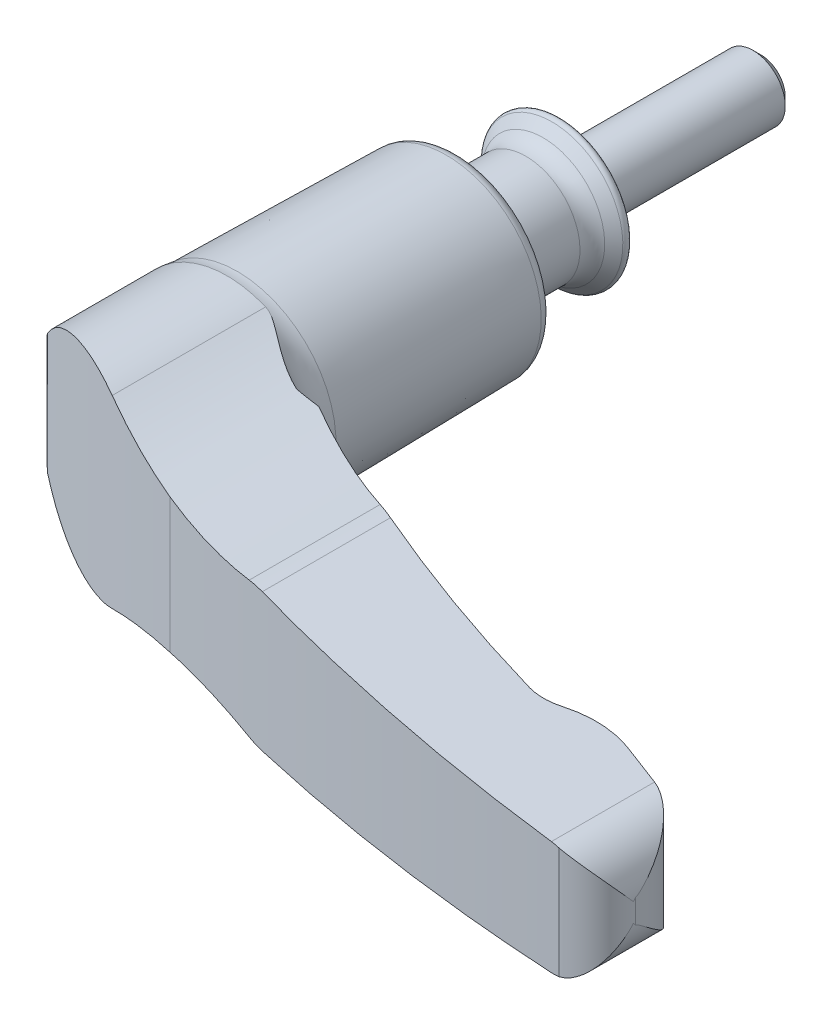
ISO-10303-21;
HEADER;
FILE_DESCRIPTION(('STEP AP214'),'2;1');
FILE_NAME('part.step','',(''),(''),'','','');
FILE_SCHEMA(('AUTOMOTIVE_DESIGN { 1 0 10303 214 1 1 1 1 }'));
ENDSEC;
DATA;
#1=APPLICATION_CONTEXT('core data for automotive mechanical design processes');
#2=APPLICATION_PROTOCOL_DEFINITION('international standard','automotive_design',2000,#1);
#3=PRODUCT_CONTEXT('',#1,'mechanical');
#4=PRODUCT('Part','Part','',(#3));
#5=PRODUCT_RELATED_PRODUCT_CATEGORY('part','',(#4));
#6=PRODUCT_DEFINITION_FORMATION('','',#4);
#7=PRODUCT_DEFINITION_CONTEXT('part definition',#1,'design');
#8=PRODUCT_DEFINITION('design','',#6,#7);
#9=PRODUCT_DEFINITION_SHAPE('','',#8);
#10=(LENGTH_UNIT() NAMED_UNIT(*) SI_UNIT(.MILLI.,.METRE.));
#11=(NAMED_UNIT(*) PLANE_ANGLE_UNIT() SI_UNIT($,.RADIAN.));
#12=(NAMED_UNIT(*) SI_UNIT($,.STERADIAN.) SOLID_ANGLE_UNIT());
#13=UNCERTAINTY_MEASURE_WITH_UNIT(LENGTH_MEASURE(1.E-05),#10,'distance_accuracy_value','');
#14=(GEOMETRIC_REPRESENTATION_CONTEXT(3) GLOBAL_UNCERTAINTY_ASSIGNED_CONTEXT((#13)) GLOBAL_UNIT_ASSIGNED_CONTEXT((#10,
#11,#12)) REPRESENTATION_CONTEXT('',''));
#15=CARTESIAN_POINT('',(0.,0.,0.));
#16=DIRECTION('',(0.,0.,1.));
#17=DIRECTION('',(1.,0.,0.));
#18=AXIS2_PLACEMENT_3D('',#15,#16,#17);
#19=CARTESIAN_POINT('',(-12.2494442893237,-13.45,40.2250875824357));
#20=DIRECTION('',(0.,0.,1.));
#21=DIRECTION('',(-1.,0.,0.));
#22=AXIS2_PLACEMENT_3D('',#19,#20,#21);
#23=PLANE('',#22);
#24=DIRECTION('',(0.,1.,0.));
#25=VECTOR('',#24,1.);
#26=CARTESIAN_POINT('',(-12.2494442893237,-13.45,40.2250875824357));
#27=LINE('',#26,#25);
#28=CARTESIAN_POINT('',(-12.2494442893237,-1.12726551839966,40.2250875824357));
#29=VERTEX_POINT('',#28);
#30=CARTESIAN_POINT('',(-12.2494442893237,0.,40.2250875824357));
#31=VERTEX_POINT('',#30);
#32=EDGE_CURVE('E175',#29,#31,#27,.T.);
#33=ORIENTED_EDGE('',*,*,#32,.T.);
#34=CARTESIAN_POINT('',(-1.62642046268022E-13,0.,40.2250875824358));
#35=DIRECTION('',(0.,0.,1.));
#36=DIRECTION('',(-1.,0.,0.));
#37=AXIS2_PLACEMENT_3D('',#34,#35,#36);
#38=CIRCLE('',#37,12.2494442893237);
#39=EDGE_CURVE('E178',#31,#31,#38,.F.);
#40=ORIENTED_EDGE('',*,*,#39,.F.);
#41=CARTESIAN_POINT('',(-12.2494442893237,1.12726551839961,40.2250875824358));
#42=VERTEX_POINT('',#41);
#43=EDGE_CURVE('E185',#31,#42,#27,.T.);
#44=ORIENTED_EDGE('',*,*,#43,.T.);
#45=CARTESIAN_POINT('',(0.,0.,40.2250875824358));
#46=DIRECTION('',(0.,0.,-1.));
#47=DIRECTION('',(1.,0.,0.));
#48=AXIS2_PLACEMENT_3D('',#45,#46,#47);
#49=CIRCLE('',#48,12.3012037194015);
#50=EDGE_CURVE('E180',#42,#29,#49,.T.);
#51=ORIENTED_EDGE('',*,*,#50,.T.);
#52=EDGE_LOOP('',(#33,#40,#44,#51));
#53=FACE_BOUND('',#52,.T.);
#54=ADVANCED_FACE('F14',(#53),#23,.F.);
#55=CARTESIAN_POINT('',(-12.3990914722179,-13.45,48.8947231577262));
#56=DIRECTION('',(0.999851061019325,0.,0.0172584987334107));
#57=DIRECTION('',(-0.0172584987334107,0.,0.999851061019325));
#58=AXIS2_PLACEMENT_3D('',#55,#56,#57);
#59=PLANE('',#58);
#60=ORIENTED_EDGE('',*,*,#43,.F.);
#61=ORIENTED_EDGE('',*,*,#32,.F.);
#62=CARTESIAN_POINT('',(-12.2494408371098,-1.12726105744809,40.2248875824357));
#63=CARTESIAN_POINT('',(-12.2501546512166,-1.12801102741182,40.2662415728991));
#64=CARTESIAN_POINT('',(-12.2508608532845,-1.13338949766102,40.3071545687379));
#65=CARTESIAN_POINT('',(-12.2522296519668,-1.15131266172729,40.3864543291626));
#66=CARTESIAN_POINT('',(-12.2528928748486,-1.16369170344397,40.4248773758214));
#67=CARTESIAN_POINT('',(-12.254538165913,-1.20206398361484,40.520195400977));
#68=CARTESIAN_POINT('',(-12.255493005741,-1.23180007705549,40.575512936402));
#69=CARTESIAN_POINT('',(-12.257344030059,-1.29909643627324,40.6827498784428));
#70=CARTESIAN_POINT('',(-12.2582382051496,-1.33683049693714,40.7345528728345));
#71=CARTESIAN_POINT('',(-12.2604895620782,-1.44052319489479,40.8649826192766));
#72=CARTESIAN_POINT('',(-12.2618006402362,-1.50977612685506,40.9409384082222));
#73=CARTESIAN_POINT('',(-12.264338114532,-1.65349391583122,41.0879440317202));
#74=CARTESIAN_POINT('',(-12.2655642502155,-1.72797350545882,41.1589787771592));
#75=CARTESIAN_POINT('',(-12.2678450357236,-1.87254522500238,41.2911134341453));
#76=CARTESIAN_POINT('',(-12.268904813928,-1.94236687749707,41.3525104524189));
#77=CARTESIAN_POINT('',(-12.2709847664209,-2.08326818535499,41.4730100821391));
#78=CARTESIAN_POINT('',(-12.2720051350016,-2.15433817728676,41.5321239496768));
#79=CARTESIAN_POINT('',(-12.2730148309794,-2.22587171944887,41.5906195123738));
#80=B_SPLINE_CURVE_WITH_KNOTS('',3,(#62,#63,#64,#65,#66,#67,#68,#69,#70,#71,#72,#73,#74,#75,#76,
#77,#78,#79),.UNSPECIFIED.,.F.,.F.,(4,2,2,2,2,2,2,2,4),(0.,0.123330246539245,0.243857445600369,
0.431247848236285,0.623227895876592,0.931023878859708,1.23972530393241,1.51862793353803,
1.79591047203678),.UNSPECIFIED.);
#81=CARTESIAN_POINT('',(-12.271249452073,-2.10212675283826,41.4883443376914));
#82=VERTEX_POINT('',#81);
#83=EDGE_CURVE('E399',#29,#82,#80,.T.);
#84=ORIENTED_EDGE('',*,*,#83,.T.);
#85=CARTESIAN_POINT('',(0.,0.,-669.432227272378));
#86=DIRECTION('',(0.999851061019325,0.,0.0172584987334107));
#87=DIRECTION('',(0.0172584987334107,0.,-0.999851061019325));
#88=AXIS2_PLACEMENT_3D('',#85,#86,#87);
#89=ELLIPSE('',#88,721.383718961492,12.45);
#90=CARTESIAN_POINT('',(-12.3990914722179,-1.12473581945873,48.8947231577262));
#91=VERTEX_POINT('',#90);
#92=EDGE_CURVE('E239',#82,#91,#89,.F.);
#93=ORIENTED_EDGE('',*,*,#92,.T.);
#94=DIRECTION('',(0.,1.,0.));
#95=VECTOR('',#94,1.);
#96=CARTESIAN_POINT('',(-12.3990914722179,-13.45,48.8947231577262));
#97=LINE('',#96,#95);
#98=CARTESIAN_POINT('',(-12.3990914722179,1.12473581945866,48.8947231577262));
#99=VERTEX_POINT('',#98);
#100=EDGE_CURVE('E184',#91,#99,#97,.T.);
#101=ORIENTED_EDGE('',*,*,#100,.T.);
#102=CARTESIAN_POINT('',(0.,0.,-669.432227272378));
#103=DIRECTION('',(0.999851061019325,0.,0.0172584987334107));
#104=DIRECTION('',(0.0172584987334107,0.,-0.999851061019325));
#105=AXIS2_PLACEMENT_3D('',#102,#103,#104);
#106=ELLIPSE('',#105,721.383718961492,12.45);
#107=CARTESIAN_POINT('',(-12.271249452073,2.10212675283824,41.4883443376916));
#108=VERTEX_POINT('',#107);
#109=EDGE_CURVE('E263',#99,#108,#106,.F.);
#110=ORIENTED_EDGE('',*,*,#109,.T.);
#111=CARTESIAN_POINT('',(-12.2730148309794,2.2258717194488,41.5906195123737));
#112=CARTESIAN_POINT('',(-12.2723484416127,2.17857656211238,41.5520130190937));
#113=CARTESIAN_POINT('',(-12.2716768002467,2.13153645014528,41.5131022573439));
#114=CARTESIAN_POINT('',(-12.2703199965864,2.03804940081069,41.4344974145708));
#115=CARTESIAN_POINT('',(-12.269634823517,1.99160298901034,41.3948027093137));
#116=CARTESIAN_POINT('',(-12.2675030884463,1.84986894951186,41.2713031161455));
#117=CARTESIAN_POINT('',(-12.2660309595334,1.75583214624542,41.1860170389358));
#118=CARTESIAN_POINT('',(-12.2637374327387,1.61936868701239,41.0531442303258));
#119=CARTESIAN_POINT('',(-12.2629577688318,1.574598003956,41.0079753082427));
#120=CARTESIAN_POINT('',(-12.2613598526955,1.48744881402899,40.9154018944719));
#121=CARTESIAN_POINT('',(-12.2605416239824,1.44506888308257,40.8679987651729));
#122=CARTESIAN_POINT('',(-12.2588634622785,1.36463549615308,40.7707764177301));
#123=CARTESIAN_POINT('',(-12.2580043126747,1.32652790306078,40.7210025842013));
#124=CARTESIAN_POINT('',(-12.2562147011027,1.25655247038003,40.6173235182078));
#125=CARTESIAN_POINT('',(-12.2552845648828,1.22465826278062,40.5634371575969));
#126=CARTESIAN_POINT('',(-12.2536883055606,1.18138793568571,40.4709597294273));
#127=CARTESIAN_POINT('',(-12.2530490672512,1.16676743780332,40.4339262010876));
#128=CARTESIAN_POINT('',(-12.2517389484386,1.14385333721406,40.3580259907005));
#129=CARTESIAN_POINT('',(-12.251068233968,1.13552979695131,40.3191689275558));
#130=CARTESIAN_POINT('',(-12.2500751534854,1.12891545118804,40.2616359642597));
#131=CARTESIAN_POINT('',(-12.2497582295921,1.12764004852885,40.2432753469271));
#132=CARTESIAN_POINT('',(-12.2494408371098,1.12726105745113,40.2248875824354));
#133=B_SPLINE_CURVE_WITH_KNOTS('',3,(#111,#112,#113,#114,#115,#116,#117,#118,#119,#120,#121,
#122,#123,#124,#125,#126,#127,#128,#129,#130,#131,#132),.UNSPECIFIED.,.F.,.F.,(4,2,2,2,2,2,2,2,
2,2,4),(0.,0.183152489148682,0.366457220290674,0.747103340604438,0.937859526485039,
1.12850085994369,1.31635856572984,1.50340080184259,1.62247471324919,1.74097889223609,
1.79613687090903),.UNSPECIFIED.);
#134=EDGE_CURVE('E190',#108,#42,#133,.T.);
#135=ORIENTED_EDGE('',*,*,#134,.T.);
#136=EDGE_LOOP('',(#60,#61,#84,#93,#101,#110,#135));
#137=FACE_BOUND('',#136,.T.);
#138=ADVANCED_FACE('F188',(#137),#59,.F.);
#139=CARTESIAN_POINT('',(111.767919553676,-13.45,-139.797819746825));
#140=DIRECTION('',(0.,1.,0.));
#141=DIRECTION('',(-1.,0.,0.));
#142=AXIS2_PLACEMENT_3D('',#139,#140,#141);
#143=CYLINDRICAL_SURFACE('',#142,208.999999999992);
#144=DIRECTION('',(0.,1.,0.));
#145=VECTOR('',#144,1.);
#146=CARTESIAN_POINT('',(15.7999999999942,-13.45,45.8662812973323));
#147=LINE('',#146,#145);
#148=CARTESIAN_POINT('',(15.8,-8.43613014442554,45.8662812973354));
#149=VERTEX_POINT('',#148);
#150=CARTESIAN_POINT('',(15.8,0.,45.8662812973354));
#151=VERTEX_POINT('',#150);
#152=EDGE_CURVE('E191',#149,#151,#147,.T.);
#153=ORIENTED_EDGE('',*,*,#152,.T.);
#154=DIRECTION('',(0.,1.,0.));
#155=VECTOR('',#154,1.);
#156=CARTESIAN_POINT('',(15.8,-13.45,45.8662812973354));
#157=LINE('',#156,#155);
#158=CARTESIAN_POINT('',(15.7999999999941,8.43613014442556,45.8662812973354));
#159=VERTEX_POINT('',#158);
#160=EDGE_CURVE('E413',#159,#151,#157,.F.);
#161=ORIENTED_EDGE('',*,*,#160,.F.);
#162=CARTESIAN_POINT('',(15.7999999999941,8.43613014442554,45.8662812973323));
#163=CARTESIAN_POINT('',(16.3870365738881,8.34717375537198,46.1697176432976));
#164=CARTESIAN_POINT('',(16.9767713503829,8.26904045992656,46.4710139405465));
#165=CARTESIAN_POINT('',(18.161091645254,8.13475115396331,47.0689822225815));
#166=CARTESIAN_POINT('',(18.7556773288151,8.07859589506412,47.3656540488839));
#167=CARTESIAN_POINT('',(20.5395968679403,7.94407204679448,48.2451118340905));
#168=CARTESIAN_POINT('',(21.7352391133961,7.89871013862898,48.8205177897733));
#169=CARTESIAN_POINT('',(24.1374209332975,7.89893976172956,49.9484747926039));
#170=CARTESIAN_POINT('',(25.3439611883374,7.94453701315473,50.5010244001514));
#171=CARTESIAN_POINT('',(27.1599173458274,8.0830634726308,51.3119106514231));
#172=CARTESIAN_POINT('',(27.7678474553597,8.14117035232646,51.5798888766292));
#173=CARTESIAN_POINT('',(28.9839481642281,8.28117670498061,52.1090693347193));
#174=CARTESIAN_POINT('',(29.5921187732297,8.36307725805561,52.370271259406));
#175=CARTESIAN_POINT('',(30.2000000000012,8.45699782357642,52.6279438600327));
#176=B_SPLINE_CURVE_WITH_KNOTS('',3,(#162,#163,#164,#165,#166,#167,#168,#169,#170,#171,#172,
#173,#174,#175),.UNSPECIFIED.,.F.,.F.,(4,2,2,2,2,2,4),(0.,2.00016069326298,4.00038978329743,
7.97994863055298,11.9597577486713,13.9600808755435,15.9604948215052),.UNSPECIFIED.);
#177=CARTESIAN_POINT('',(30.2000000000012,8.45699782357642,52.6279438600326));
#178=VERTEX_POINT('',#177);
#179=EDGE_CURVE('E264',#159,#178,#176,.T.);
#180=ORIENTED_EDGE('',*,*,#179,.T.);
#181=CARTESIAN_POINT('',(32.4002231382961,8.59297245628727,53.5458348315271));
#182=CARTESIAN_POINT('',(32.2157966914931,8.59945246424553,53.4701291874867));
#183=CARTESIAN_POINT('',(32.0313583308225,8.60144694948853,53.3941076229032));
#184=CARTESIAN_POINT('',(31.6631700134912,8.59650662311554,53.2417318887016));
#185=CARTESIAN_POINT('',(31.4794194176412,8.58958963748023,53.1653786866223));
#186=CARTESIAN_POINT('',(30.9288846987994,8.55552869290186,52.9356990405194));
#187=CARTESIAN_POINT('',(30.5630943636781,8.51506518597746,52.7818661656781));
#188=CARTESIAN_POINT('',(30.2000000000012,8.45699782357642,52.6279438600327));
#189=B_SPLINE_CURVE_WITH_KNOTS('',3,(#181,#182,#183,#184,#185,#186,#187,#188),.UNSPECIFIED.,.F.,
.F.,(4,2,2,4),(0.,0.598316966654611,1.19543895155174,2.3905773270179),.UNSPECIFIED.);
#190=CARTESIAN_POINT('',(32.4002231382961,8.59297245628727,53.5458348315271));
#191=VERTEX_POINT('',#190);
#192=EDGE_CURVE('E342',#191,#178,#189,.T.);
#193=ORIENTED_EDGE('',*,*,#192,.F.);
#194=CARTESIAN_POINT('',(111.767919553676,5.80486876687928,-139.797819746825));
#195=DIRECTION('',(-0.0351072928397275,-0.999383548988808,0.));
#196=DIRECTION('',(-0.999383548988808,0.0351072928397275,0.));
#197=AXIS2_PLACEMENT_3D('',#194,#195,#196);
#198=ELLIPSE('',#197,209.128917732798,208.999999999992);
#199=CARTESIAN_POINT('',(58.4999999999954,7.67611474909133,62.2999999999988));
#200=VERTEX_POINT('',#199);
#201=EDGE_CURVE('E350',#200,#191,#198,.T.);
#202=ORIENTED_EDGE('',*,*,#201,.F.);
#203=DIRECTION('',(0.,1.,0.));
#204=VECTOR('',#203,1.);
#205=CARTESIAN_POINT('',(58.4999999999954,-13.45,62.2999999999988));
#206=LINE('',#205,#204);
#207=CARTESIAN_POINT('',(58.4999999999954,-7.67611474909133,62.2999999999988));
#208=VERTEX_POINT('',#207);
#209=EDGE_CURVE('E193',#208,#200,#206,.T.);
#210=ORIENTED_EDGE('',*,*,#209,.F.);
#211=CARTESIAN_POINT('',(111.767919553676,-5.80486876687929,-139.797819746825));
#212=DIRECTION('',(-0.0351072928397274,0.999383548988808,0.));
#213=DIRECTION('',(0.999383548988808,0.0351072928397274,0.));
#214=AXIS2_PLACEMENT_3D('',#211,#212,#213);
#215=ELLIPSE('',#214,209.128917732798,208.999999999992);
#216=CARTESIAN_POINT('',(32.4002231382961,-8.59297245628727,53.5458348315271));
#217=VERTEX_POINT('',#216);
#218=EDGE_CURVE('E817',#217,#208,#215,.T.);
#219=ORIENTED_EDGE('',*,*,#218,.F.);
#220=CARTESIAN_POINT('',(30.2000000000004,-8.45699782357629,52.6279438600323));
#221=CARTESIAN_POINT('',(30.5630943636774,-8.51506518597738,52.7818661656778));
#222=CARTESIAN_POINT('',(30.9288846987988,-8.55552869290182,52.9356990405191));
#223=CARTESIAN_POINT('',(31.4794194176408,-8.58958963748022,53.1653786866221));
#224=CARTESIAN_POINT('',(31.6631700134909,-8.59650662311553,53.2417318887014));
#225=CARTESIAN_POINT('',(32.0313583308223,-8.60144694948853,53.3941076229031));
#226=CARTESIAN_POINT('',(32.215796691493,-8.59945246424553,53.4701291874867));
#227=CARTESIAN_POINT('',(32.4002231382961,-8.59297245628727,53.5458348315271));
#228=B_SPLINE_CURVE_WITH_KNOTS('',3,(#220,#221,#222,#223,#224,#225,#226,#227),.UNSPECIFIED.,.F.,
.F.,(4,2,2,4),(0.,1.19513837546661,1.79226036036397,2.39057732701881),.UNSPECIFIED.);
#229=CARTESIAN_POINT('',(30.2000000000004,-8.45699782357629,52.6279438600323));
#230=VERTEX_POINT('',#229);
#231=EDGE_CURVE('E317',#230,#217,#228,.T.);
#232=ORIENTED_EDGE('',*,*,#231,.F.);
#233=CARTESIAN_POINT('',(30.2,-8.45699782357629,52.6279438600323));
#234=CARTESIAN_POINT('',(29.5921187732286,-8.36307725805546,52.3702712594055));
#235=CARTESIAN_POINT('',(28.983948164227,-8.28117670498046,52.1090693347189));
#236=CARTESIAN_POINT('',(27.7678474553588,-8.14117035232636,51.5798888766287));
#237=CARTESIAN_POINT('',(27.1599173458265,-8.08306347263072,51.3119106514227));
#238=CARTESIAN_POINT('',(25.3439611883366,-7.94453701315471,50.5010244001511));
#239=CARTESIAN_POINT('',(24.1374209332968,-7.89893976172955,49.9484747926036));
#240=CARTESIAN_POINT('',(21.7352391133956,-7.89871013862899,48.820517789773));
#241=CARTESIAN_POINT('',(20.5395968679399,-7.9440720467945,48.2451118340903));
#242=CARTESIAN_POINT('',(18.7556773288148,-8.07859589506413,47.3656540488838));
#243=CARTESIAN_POINT('',(18.1610916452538,-8.13475115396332,47.0689822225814));
#244=CARTESIAN_POINT('',(16.9767713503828,-8.26904045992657,46.4710139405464));
#245=CARTESIAN_POINT('',(16.387036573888,-8.34717375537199,46.1697176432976));
#246=CARTESIAN_POINT('',(15.7999999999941,-8.43613014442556,45.8662812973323));
#247=B_SPLINE_CURVE_WITH_KNOTS('',3,(#233,#234,#235,#236,#237,#238,#239,#240,#241,#242,#243,
#244,#245,#246),.UNSPECIFIED.,.F.,.F.,(4,2,2,2,2,2,4),(0.,2.00041394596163,4.00073707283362,
7.98054619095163,11.9601050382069,13.9603341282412,15.960494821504),.UNSPECIFIED.);
#248=EDGE_CURVE('E335',#230,#149,#247,.T.);
#249=ORIENTED_EDGE('',*,*,#248,.T.);
#250=EDGE_LOOP('',(#153,#161,#180,#193,#202,#210,#219,#232,#249));
#251=FACE_BOUND('',#250,.T.);
#252=ADVANCED_FACE('F325',(#251),#143,.F.);
#253=CARTESIAN_POINT('',(76.9,-13.45,77.));
#254=DIRECTION('',(0.,0.,-1.));
#255=DIRECTION('',(0.,1.,0.));
#256=AXIS2_PLACEMENT_3D('',#253,#254,#255);
#257=PLANE('',#256);
#258=DIRECTION('',(0.,1.,0.));
#259=VECTOR('',#258,1.);
#260=CARTESIAN_POINT('',(76.9,-13.45,77.));
#261=LINE('',#260,#259);
#262=CARTESIAN_POINT('',(76.9,-6.92676825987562,77.));
#263=VERTEX_POINT('',#262);
#264=CARTESIAN_POINT('',(76.9,6.92676825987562,77.));
#265=VERTEX_POINT('',#264);
#266=EDGE_CURVE('E790',#263,#265,#261,.T.);
#267=ORIENTED_EDGE('',*,*,#266,.T.);
#268=CARTESIAN_POINT('',(75.6,1.17177043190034,77.));
#269=DIRECTION('',(0.,0.,-1.));
#270=DIRECTION('',(0.,1.,0.));
#271=AXIS2_PLACEMENT_3D('',#268,#269,#270);
#272=CIRCLE('',#271,5.9);
#273=CARTESIAN_POINT('',(76.8,6.94844767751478,77.));
#274=VERTEX_POINT('',#273);
#275=EDGE_CURVE('E860',#265,#274,#272,.F.);
#276=ORIENTED_EDGE('',*,*,#275,.T.);
#277=DIRECTION('',(0.,1.,0.));
#278=VECTOR('',#277,1.);
#279=CARTESIAN_POINT('',(76.8,-13.45,77.));
#280=LINE('',#279,#278);
#281=CARTESIAN_POINT('',(76.8,-6.94844767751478,77.));
#282=VERTEX_POINT('',#281);
#283=EDGE_CURVE('E788',#282,#274,#280,.T.);
#284=ORIENTED_EDGE('',*,*,#283,.F.);
#285=CARTESIAN_POINT('',(75.6,-1.17177043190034,77.));
#286=DIRECTION('',(0.,0.,-1.));
#287=DIRECTION('',(0.,1.,0.));
#288=AXIS2_PLACEMENT_3D('',#285,#286,#287);
#289=CIRCLE('',#288,5.9);
#290=EDGE_CURVE('E903',#282,#263,#289,.F.);
#291=ORIENTED_EDGE('',*,*,#290,.T.);
#292=EDGE_LOOP('',(#267,#276,#284,#291));
#293=FACE_BOUND('',#292,.T.);
#294=ADVANCED_FACE('F329',(#293),#257,.F.);
#295=CARTESIAN_POINT('',(99.3774025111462,-13.45,-191.753327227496));
#296=DIRECTION('',(0.,1.,0.));
#297=DIRECTION('',(-1.,0.,0.));
#298=AXIS2_PLACEMENT_3D('',#295,#296,#297);
#299=CYLINDRICAL_SURFACE('',#298,269.7);
#300=CARTESIAN_POINT('',(16.1999999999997,8.37725139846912,64.8));
#301=CARTESIAN_POINT('',(16.7767031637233,8.29486390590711,64.9869756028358));
#302=CARTESIAN_POINT('',(17.3553557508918,8.22300064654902,65.1724296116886));
#303=CARTESIAN_POINT('',(18.5159500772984,8.10050516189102,65.5400576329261));
#304=CARTESIAN_POINT('',(19.0978918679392,8.04987326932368,65.7222315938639));
#305=CARTESIAN_POINT('',(20.8414876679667,7.93052773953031,66.2615450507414));
#306=CARTESIAN_POINT('',(22.0070770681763,7.89348273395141,66.6134754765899));
#307=CARTESIAN_POINT('',(24.3425845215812,7.90540743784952,67.3013928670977));
#308=CARTESIAN_POINT('',(25.512502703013,7.95437971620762,67.6373793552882));
#309=CARTESIAN_POINT('',(27.2687809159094,8.09314767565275,68.1289718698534));
#310=CARTESIAN_POINT('',(27.8560018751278,8.15052863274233,68.2911856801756));
#311=CARTESIAN_POINT('',(29.0291528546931,8.28726693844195,68.611001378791));
#312=CARTESIAN_POINT('',(29.6150828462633,8.36662477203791,68.7686031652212));
#313=CARTESIAN_POINT('',(30.2000000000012,8.45699782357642,68.9238236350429));
#314=B_SPLINE_CURVE_WITH_KNOTS('',3,(#300,#301,#302,#303,#304,#305,#306,#307,#308,#309,#310,
#311,#312,#313),.UNSPECIFIED.,.F.,.F.,(4,2,2,2,2,2,4),(0.,1.83529834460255,3.6706254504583,
7.32170279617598,10.9728891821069,12.808257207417,14.6436657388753),.UNSPECIFIED.);
#315=CARTESIAN_POINT('',(16.1999999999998,8.37725139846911,64.8));
#316=VERTEX_POINT('',#315);
#317=CARTESIAN_POINT('',(30.2000000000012,8.45699782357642,68.9238236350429));
#318=VERTEX_POINT('',#317);
#319=EDGE_CURVE('E775',#316,#318,#314,.T.);
#320=ORIENTED_EDGE('',*,*,#319,.F.);
#321=DIRECTION('',(0.,1.,0.));
#322=VECTOR('',#321,1.);
#323=CARTESIAN_POINT('',(16.1999999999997,-13.45,64.8));
#324=LINE('',#323,#322);
#325=CARTESIAN_POINT('',(16.1999999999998,-8.37725139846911,64.8));
#326=VERTEX_POINT('',#325);
#327=EDGE_CURVE('E349',#326,#316,#324,.T.);
#328=ORIENTED_EDGE('',*,*,#327,.F.);
#329=CARTESIAN_POINT('',(30.2,-8.45699782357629,68.9238236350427));
#330=CARTESIAN_POINT('',(29.6150828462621,-8.36662477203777,68.7686031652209));
#331=CARTESIAN_POINT('',(29.029152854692,-8.28726693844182,68.6110013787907));
#332=CARTESIAN_POINT('',(27.8560018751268,-8.15052863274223,68.2911856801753));
#333=CARTESIAN_POINT('',(27.2687809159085,-8.09314767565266,68.1289718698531));
#334=CARTESIAN_POINT('',(25.5125027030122,-7.95437971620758,67.637379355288));
#335=CARTESIAN_POINT('',(24.3425845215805,-7.9054074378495,67.3013928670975));
#336=CARTESIAN_POINT('',(22.0070770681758,-7.89348273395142,66.6134754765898));
#337=CARTESIAN_POINT('',(20.8414876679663,-7.93052773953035,66.2615450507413));
#338=CARTESIAN_POINT('',(19.097891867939,-8.0498732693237,65.7222315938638));
#339=CARTESIAN_POINT('',(18.5159500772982,-8.10050516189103,65.540057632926));
#340=CARTESIAN_POINT('',(17.3553557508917,-8.22300064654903,65.1724296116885));
#341=CARTESIAN_POINT('',(16.7767031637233,-8.29486390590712,64.9869756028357));
#342=CARTESIAN_POINT('',(16.1999999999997,-8.37725139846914,64.8));
#343=B_SPLINE_CURVE_WITH_KNOTS('',3,(#329,#330,#331,#332,#333,#334,#335,#336,#337,#338,#339,
#340,#341,#342),.UNSPECIFIED.,.F.,.F.,(4,2,2,2,2,2,4),(0.,1.83540853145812,3.67077655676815,
7.32196294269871,10.9730402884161,12.8083673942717,14.6436657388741),.UNSPECIFIED.);
#344=CARTESIAN_POINT('',(30.2000000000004,-8.45699782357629,68.9238236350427));
#345=VERTEX_POINT('',#344);
#346=EDGE_CURVE('E446',#345,#326,#343,.T.);
#347=ORIENTED_EDGE('',*,*,#346,.F.);
#348=CARTESIAN_POINT('',(30.2000000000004,-8.45699782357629,68.9238236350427));
#349=CARTESIAN_POINT('',(30.5632894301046,-8.51510955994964,69.0202386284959));
#350=CARTESIAN_POINT('',(30.9292671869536,-8.55556829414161,69.1165394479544));
#351=CARTESIAN_POINT('',(31.4798508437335,-8.58960835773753,69.2601745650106));
#352=CARTESIAN_POINT('',(31.6635722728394,-8.5965163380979,69.3078974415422));
#353=CARTESIAN_POINT('',(32.0316308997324,-8.60144626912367,69.4030885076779));
#354=CARTESIAN_POINT('',(32.21596856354,-8.59944866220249,69.4505559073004));
#355=CARTESIAN_POINT('',(32.4002231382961,-8.59297245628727,69.4977922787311));
#356=B_SPLINE_CURVE_WITH_KNOTS('',3,(#348,#349,#350,#351,#352,#353,#354,#355),.UNSPECIFIED.,.F.,
.F.,(4,2,2,4),(0.,1.14021168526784,1.70984874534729,2.2807374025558),.UNSPECIFIED.);
#357=CARTESIAN_POINT('',(32.4002231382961,-8.59297245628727,69.497792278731));
#358=VERTEX_POINT('',#357);
#359=EDGE_CURVE('E292',#345,#358,#356,.T.);
#360=ORIENTED_EDGE('',*,*,#359,.T.);
#361=CARTESIAN_POINT('',(99.3774025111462,-6.24013459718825,-191.753327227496));
#362=DIRECTION('',(-0.0351072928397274,0.999383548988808,0.));
#363=DIRECTION('',(0.999383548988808,0.0351072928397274,0.));
#364=AXIS2_PLACEMENT_3D('',#361,#362,#363);
#365=ELLIPSE('',#364,269.866359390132,269.7);
#366=CARTESIAN_POINT('',(75.8071330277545,-7.06813337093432,76.9147438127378));
#367=VERTEX_POINT('',#366);
#368=EDGE_CURVE('E304',#358,#367,#365,.T.);
#369=ORIENTED_EDGE('',*,*,#368,.T.);
#370=CARTESIAN_POINT('',(75.8071330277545,-7.06813337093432,76.9147438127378));
#371=CARTESIAN_POINT('',(75.9742663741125,-7.06223993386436,76.929403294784));
#372=CARTESIAN_POINT('',(76.1405719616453,-7.04931940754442,76.943837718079));
#373=CARTESIAN_POINT('',(76.4715276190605,-7.00942417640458,76.9722564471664));
#374=CARTESIAN_POINT('',(76.6361776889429,-6.98244947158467,76.9862407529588));
#375=CARTESIAN_POINT('',(76.8,-6.94844767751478,77.));
#376=B_SPLINE_CURVE_WITH_KNOTS('',3,(#370,#371,#372,#373,#374,#375),.UNSPECIFIED.,.F.,.F.,(4,2,
4),(0.,0.50229032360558,1.00458064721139),.UNSPECIFIED.);
#377=EDGE_CURVE('E905',#367,#282,#376,.T.);
#378=ORIENTED_EDGE('',*,*,#377,.T.);
#379=ORIENTED_EDGE('',*,*,#283,.T.);
#380=CARTESIAN_POINT('',(76.8,6.94844767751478,77.));
#381=CARTESIAN_POINT('',(76.6361776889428,6.98244947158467,76.9862407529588));
#382=CARTESIAN_POINT('',(76.4715276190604,7.00942417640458,76.9722564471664));
#383=CARTESIAN_POINT('',(76.1405719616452,7.04931940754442,76.943837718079));
#384=CARTESIAN_POINT('',(75.9742663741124,7.06223993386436,76.929403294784));
#385=CARTESIAN_POINT('',(75.8071330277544,7.06813337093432,76.9147438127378));
#386=B_SPLINE_CURVE_WITH_KNOTS('',3,(#380,#381,#382,#383,#384,#385),.UNSPECIFIED.,.F.,.F.,(4,2,
4),(0.,0.502290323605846,1.00458064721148),.UNSPECIFIED.);
#387=CARTESIAN_POINT('',(75.8071330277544,7.06813337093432,76.9147438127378));
#388=VERTEX_POINT('',#387);
#389=EDGE_CURVE('E847',#274,#388,#386,.T.);
#390=ORIENTED_EDGE('',*,*,#389,.T.);
#391=CARTESIAN_POINT('',(99.3774025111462,6.24013459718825,-191.753327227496));
#392=DIRECTION('',(-0.0351072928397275,-0.999383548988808,0.));
#393=DIRECTION('',(-0.999383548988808,0.0351072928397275,0.));
#394=AXIS2_PLACEMENT_3D('',#391,#392,#393);
#395=ELLIPSE('',#394,269.866359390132,269.7);
#396=CARTESIAN_POINT('',(32.4002231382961,8.59297245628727,69.497792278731));
#397=VERTEX_POINT('',#396);
#398=EDGE_CURVE('E372',#388,#397,#395,.T.);
#399=ORIENTED_EDGE('',*,*,#398,.T.);
#400=CARTESIAN_POINT('',(32.4002231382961,8.59297245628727,69.497792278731));
#401=CARTESIAN_POINT('',(32.2159685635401,8.59944866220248,69.4505559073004));
#402=CARTESIAN_POINT('',(32.0316308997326,8.60144626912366,69.4030885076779));
#403=CARTESIAN_POINT('',(31.6635722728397,8.5965163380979,69.3078974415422));
#404=CARTESIAN_POINT('',(31.4798508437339,8.58960835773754,69.2601745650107));
#405=CARTESIAN_POINT('',(30.9292671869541,8.55556829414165,69.1165394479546));
#406=CARTESIAN_POINT('',(30.5632894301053,8.51510955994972,69.0202386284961));
#407=CARTESIAN_POINT('',(30.2000000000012,8.45699782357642,68.9238236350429));
#408=B_SPLINE_CURVE_WITH_KNOTS('',3,(#400,#401,#402,#403,#404,#405,#406,#407),.UNSPECIFIED.,.F.,
.F.,(4,2,2,4),(0.,0.5708886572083,1.14052571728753,2.28073740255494),.UNSPECIFIED.);
#409=EDGE_CURVE('E363',#397,#318,#408,.T.);
#410=ORIENTED_EDGE('',*,*,#409,.T.);
#411=EDGE_LOOP('',(#320,#328,#347,#360,#369,#378,#379,#390,#399,#410));
#412=FACE_BOUND('',#411,.T.);
#413=ADVANCED_FACE('F306',(#412),#299,.T.);
#414=CARTESIAN_POINT('',(79.8840849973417,-13.45,-124.78991881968));
#415=DIRECTION('',(0.,1.,0.));
#416=DIRECTION('',(-1.,0.,0.));
#417=AXIS2_PLACEMENT_3D('',#414,#415,#416);
#418=CYLINDRICAL_SURFACE('',#417,200.000000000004);
#419=DIRECTION('',(0.,1.,0.));
#420=VECTOR('',#419,1.);
#421=CARTESIAN_POINT('',(-9.90000000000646,-13.45,53.9244289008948));
#422=LINE('',#421,#420);
#423=CARTESIAN_POINT('',(-9.90000000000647,-7.54933771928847,53.9244289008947));
#424=VERTEX_POINT('',#423);
#425=CARTESIAN_POINT('',(-9.90000000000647,7.54933771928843,53.9244289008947));
#426=VERTEX_POINT('',#425);
#427=EDGE_CURVE('E199',#424,#426,#422,.T.);
#428=ORIENTED_EDGE('',*,*,#427,.F.);
#429=CARTESIAN_POINT('',(-9.90000000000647,-7.54933771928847,53.9244289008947));
#430=CARTESIAN_POINT('',(-9.67451817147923,-7.84507120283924,54.0377127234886));
#431=CARTESIAN_POINT('',(-9.4368447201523,-8.12923310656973,54.1565790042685));
#432=CARTESIAN_POINT('',(-8.93966759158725,-8.67296304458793,54.403880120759));
#433=CARTESIAN_POINT('',(-8.68017587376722,-8.93254438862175,54.5323097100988));
#434=CARTESIAN_POINT('',(-8.14219185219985,-9.42550410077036,54.7970082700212));
#435=CARTESIAN_POINT('',(-7.86373776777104,-9.65893280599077,54.9332613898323));
#436=CARTESIAN_POINT('',(-7.28965149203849,-10.0992248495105,55.2124187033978));
#437=CARTESIAN_POINT('',(-6.994017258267,-10.3060850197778,55.3553236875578));
#438=CARTESIAN_POINT('',(-6.38843577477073,-10.6920089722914,55.6461218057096));
#439=CARTESIAN_POINT('',(-6.07851806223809,-10.8711270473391,55.7940044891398));
#440=CARTESIAN_POINT('',(-5.44596700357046,-11.2013953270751,56.0937585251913));
#441=CARTESIAN_POINT('',(-5.12333306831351,-11.3525442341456,56.2456300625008));
#442=CARTESIAN_POINT('',(-4.46756903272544,-11.6262415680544,56.5521043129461));
#443=CARTESIAN_POINT('',(-4.13444284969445,-11.7488005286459,56.7067059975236));
#444=CARTESIAN_POINT('',(-3.45976822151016,-11.9648655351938,57.0175072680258));
#445=CARTESIAN_POINT('',(-3.11822142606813,-12.0583772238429,57.1737065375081));
#446=CARTESIAN_POINT('',(-2.31903314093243,-12.2409805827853,57.5364253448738));
#447=CARTESIAN_POINT('',(-1.85895294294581,-12.3192478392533,57.743179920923));
#448=CARTESIAN_POINT('',(-1.16440659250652,-12.3976193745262,58.0521070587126));
#449=CARTESIAN_POINT('',(-0.932215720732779,-12.4172382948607,58.1548548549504));
#450=CARTESIAN_POINT('',(-0.466758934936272,-12.443430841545,58.3597645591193));
#451=CARTESIAN_POINT('',(-0.233492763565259,-12.4500011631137,58.4619263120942));
#452=CARTESIAN_POINT('',(0.405450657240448,-12.4499979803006,58.7403022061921));
#453=CARTESIAN_POINT('',(0.811584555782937,-12.4301810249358,58.9156432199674));
#454=CARTESIAN_POINT('',(1.62179032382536,-12.3506318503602,59.2622685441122));
#455=CARTESIAN_POINT('',(2.02586144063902,-12.2908859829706,59.4335514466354));
#456=CARTESIAN_POINT('',(2.83079805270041,-12.1308842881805,59.7716755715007));
#457=CARTESIAN_POINT('',(3.23162970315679,-12.030387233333,59.9384839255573));
#458=CARTESIAN_POINT('',(4.02384464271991,-11.7891025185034,60.2652335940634));
#459=CARTESIAN_POINT('',(4.41522782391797,-11.6483143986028,60.4251748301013));
#460=CARTESIAN_POINT('',(4.79999999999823,-11.4874931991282,60.5810071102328));
#461=B_SPLINE_CURVE_WITH_KNOTS('',3,(#429,#430,#431,#432,#433,#434,#435,#436,#437,#438,#439,
#440,#441,#442,#443,#444,#445,#446,#447,#448,#449,#450,#451,#452,#453,#454,#455,#456,#457,#458,
#459,#460),.UNSPECIFIED.,.F.,.F.,(4,2,2,2,2,2,2,2,2,2,2,2,2,2,2,4),(0.,1.16572536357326,
2.33081586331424,3.49362387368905,4.65657040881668,5.81721142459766,6.97790627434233,
8.1381727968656,9.29821378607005,10.8264676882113,11.5901890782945,12.3541038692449,
13.6806107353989,15.007571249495,16.3425041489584,17.67745228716),.UNSPECIFIED.);
#462=CARTESIAN_POINT('',(4.79999999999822,-11.4874931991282,60.5810071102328));
#463=VERTEX_POINT('',#462);
#464=EDGE_CURVE('E202',#424,#463,#461,.T.);
#465=ORIENTED_EDGE('',*,*,#464,.T.);
#466=CARTESIAN_POINT('',(16.1999999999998,-8.37725139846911,64.8));
#467=CARTESIAN_POINT('',(15.21368787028,-8.51813618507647,64.4687294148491));
#468=CARTESIAN_POINT('',(14.2339762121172,-8.68971619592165,64.1310391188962));
#469=CARTESIAN_POINT('',(12.2943158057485,-9.09213654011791,63.4457683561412));
#470=CARTESIAN_POINT('',(11.3343097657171,-9.32276678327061,63.0982267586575));
#471=CARTESIAN_POINT('',(9.43367460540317,-9.8421618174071,62.3938598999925));
#472=CARTESIAN_POINT('',(8.49304509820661,-10.1309254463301,62.0370348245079));
#473=CARTESIAN_POINT('',(6.63069309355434,-10.7662294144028,61.3147410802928));
#474=CARTESIAN_POINT('',(5.70904885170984,-11.1129696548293,60.9492463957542));
#475=CARTESIAN_POINT('',(4.79999999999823,-11.4874931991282,60.5810071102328));
#476=B_SPLINE_CURVE_WITH_KNOTS('',3,(#466,#467,#468,#469,#470,#471,#472,#473,#474,#475),
.UNSPECIFIED.,.F.,.F.,(4,2,2,2,4),(0.,3.14928931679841,6.2875260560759,9.42570006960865,
12.5749263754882),.UNSPECIFIED.);
#477=EDGE_CURVE('E211',#326,#463,#476,.T.);
#478=ORIENTED_EDGE('',*,*,#477,.F.);
#479=ORIENTED_EDGE('',*,*,#327,.T.);
#480=CARTESIAN_POINT('',(4.7999999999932,11.4874931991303,60.5810071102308));
#481=CARTESIAN_POINT('',(5.70904885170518,11.1129696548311,60.9492463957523));
#482=CARTESIAN_POINT('',(6.63069309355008,10.7662294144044,61.3147410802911));
#483=CARTESIAN_POINT('',(8.49304509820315,10.1309254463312,62.0370348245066));
#484=CARTESIAN_POINT('',(9.43367460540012,9.84216181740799,62.3938598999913));
#485=CARTESIAN_POINT('',(11.3343097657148,9.32276678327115,63.0982267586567));
#486=CARTESIAN_POINT('',(12.2943158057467,9.0921365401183,63.4457683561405));
#487=CARTESIAN_POINT('',(14.2339762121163,8.6897161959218,64.1310391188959));
#488=CARTESIAN_POINT('',(15.2136878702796,8.51813618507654,64.4687294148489));
#489=CARTESIAN_POINT('',(16.1999999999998,8.37725139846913,64.8));
#490=B_SPLINE_CURVE_WITH_KNOTS('',3,(#480,#481,#482,#483,#484,#485,#486,#487,#488,#489),
.UNSPECIFIED.,.F.,.F.,(4,2,2,2,4),(0.,3.14922630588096,6.28740031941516,9.42563705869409,
12.574926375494),.UNSPECIFIED.);
#491=CARTESIAN_POINT('',(4.7999999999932,11.4874931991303,60.5810071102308));
#492=VERTEX_POINT('',#491);
#493=EDGE_CURVE('E293',#492,#316,#490,.T.);
#494=ORIENTED_EDGE('',*,*,#493,.F.);
#495=CARTESIAN_POINT('',(4.79999999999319,11.4874931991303,60.5810071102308));
#496=CARTESIAN_POINT('',(4.41580947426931,11.6480694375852,60.425410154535));
#497=CARTESIAN_POINT('',(4.02503382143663,11.7886738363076,60.2657194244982));
#498=CARTESIAN_POINT('',(3.23419246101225,12.0296727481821,59.9395455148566));
#499=CARTESIAN_POINT('',(2.8341300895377,12.1300814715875,59.7730647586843));
#500=CARTESIAN_POINT('',(2.02936760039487,12.2903278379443,59.4350346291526));
#501=CARTESIAN_POINT('',(1.62468227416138,12.3502704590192,59.2634995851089));
#502=CARTESIAN_POINT('',(0.8131282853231,12.4301064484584,58.9163098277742));
#503=CARTESIAN_POINT('',(0.406259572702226,12.4499988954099,58.7406550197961));
#504=CARTESIAN_POINT('',(-0.381370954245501,12.4500010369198,58.3974981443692));
#505=CARTESIAN_POINT('',(-0.762205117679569,12.432473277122,58.230155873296));
#506=CARTESIAN_POINT('',(-1.52013839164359,12.3627058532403,57.8943010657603));
#507=CARTESIAN_POINT('',(-1.89723770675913,12.310468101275,57.7257885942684));
#508=CARTESIAN_POINT('',(-2.64540716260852,12.1716555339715,57.3887062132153));
#509=CARTESIAN_POINT('',(-3.0164722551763,12.0850533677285,57.2201363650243));
#510=CARTESIAN_POINT('',(-3.74968971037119,11.8780234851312,56.884389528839));
#511=CARTESIAN_POINT('',(-4.11184217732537,11.7575961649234,56.717212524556));
#512=CARTESIAN_POINT('',(-4.82530709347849,11.4832593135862,56.3853387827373));
#513=CARTESIAN_POINT('',(-5.17659902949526,11.329290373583,56.2206470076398));
#514=CARTESIAN_POINT('',(-5.86509267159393,10.9886630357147,55.8955080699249));
#515=CARTESIAN_POINT('',(-6.20229273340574,10.8020008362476,55.7350614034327));
#516=CARTESIAN_POINT('',(-6.85929279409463,10.3971732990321,55.4202886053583));
#517=CARTESIAN_POINT('',(-7.17912282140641,10.1790648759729,55.2659520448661));
#518=CARTESIAN_POINT('',(-7.79913838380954,9.71218172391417,54.9648338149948));
#519=CARTESIAN_POINT('',(-8.09933309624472,9.46342148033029,54.8180486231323));
#520=CARTESIAN_POINT('',(-8.6621015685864,8.9502892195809,54.5412436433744));
#521=CARTESIAN_POINT('',(-8.92582503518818,8.6874365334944,54.410747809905));
#522=CARTESIAN_POINT('',(-9.43052390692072,8.13678568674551,54.1597401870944));
#523=CARTESIAN_POINT('',(-9.67151657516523,7.8490067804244,54.03922082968));
#524=CARTESIAN_POINT('',(-9.90000000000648,7.54933771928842,53.9244289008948));
#525=B_SPLINE_CURVE_WITH_KNOTS('',3,(#495,#496,#497,#498,#499,#500,#501,#502,#503,#504,#505,
#506,#507,#508,#509,#510,#511,#512,#513,#514,#515,#516,#517,#518,#519,#520,#521,#522,#523,#524),
.UNSPECIFIED.,.F.,.F.,(4,2,2,2,2,2,2,2,2,2,2,2,2,2,4),(0.,1.33291829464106,2.66536494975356,
3.99434151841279,5.32334866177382,6.5709370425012,7.81845670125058,9.06697126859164,
10.3154712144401,11.5662007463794,12.8170758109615,14.0657146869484,15.3137657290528,
16.4958742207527,17.6770775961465),.UNSPECIFIED.);
#526=EDGE_CURVE('E286',#492,#426,#525,.T.);
#527=ORIENTED_EDGE('',*,*,#526,.T.);
#528=EDGE_LOOP('',(#428,#465,#478,#479,#494,#527));
#529=FACE_BOUND('',#528,.T.);
#530=ADVANCED_FACE('F248',(#529),#418,.T.);
#531=CARTESIAN_POINT('',(-6.3,-13.45,49.0000000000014));
#532=DIRECTION('',(0.,1.,0.));
#533=DIRECTION('',(-1.,0.,0.));
#534=AXIS2_PLACEMENT_3D('',#531,#532,#533);
#535=CYLINDRICAL_SURFACE('',#534,6.1);
#536=ORIENTED_EDGE('',*,*,#427,.T.);
#537=CARTESIAN_POINT('',(-9.90000000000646,7.54933771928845,53.9244289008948));
#538=CARTESIAN_POINT('',(-10.0046272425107,7.41212768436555,53.8479316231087));
#539=CARTESIAN_POINT('',(-10.1057058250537,7.27366477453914,53.7689319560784));
#540=CARTESIAN_POINT('',(-10.3008751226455,6.99453251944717,53.6064237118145));
#541=CARTESIAN_POINT('',(-10.3949674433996,6.8538636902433,53.5229161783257));
#542=CARTESIAN_POINT('',(-10.6668294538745,6.42916605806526,53.2664803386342));
#543=CARTESIAN_POINT('',(-10.8343792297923,6.14218866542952,53.0874940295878));
#544=CARTESIAN_POINT('',(-11.1421944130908,5.56422896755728,52.7176240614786));
#545=CARTESIAN_POINT('',(-11.2826072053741,5.27327804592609,52.5268125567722));
#546=CARTESIAN_POINT('',(-11.5382549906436,4.68755769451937,52.1345668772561));
#547=CARTESIAN_POINT('',(-11.6534929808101,4.39278872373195,51.9331339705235));
#548=CARTESIAN_POINT('',(-11.822924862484,3.90661945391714,51.5940966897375));
#549=CARTESIAN_POINT('',(-11.8842552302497,3.71572911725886,51.4592618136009));
#550=CARTESIAN_POINT('',(-11.9969703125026,3.33388552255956,51.1855148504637));
#551=CARTESIAN_POINT('',(-12.0483542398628,3.14293226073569,51.0466024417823));
#552=CARTESIAN_POINT('',(-12.1260618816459,2.82462255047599,50.8102464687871));
#553=CARTESIAN_POINT('',(-12.1550800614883,2.6969298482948,50.7141297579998));
#554=CARTESIAN_POINT('',(-12.2086854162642,2.44281059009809,50.5191072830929));
#555=CARTESIAN_POINT('',(-12.2332743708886,2.31638354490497,50.420202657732));
#556=CARTESIAN_POINT('',(-12.2704776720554,2.10831497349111,50.2522334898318));
#557=CARTESIAN_POINT('',(-12.2843345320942,2.02594231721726,50.1843484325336));
#558=CARTESIAN_POINT('',(-12.3100752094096,1.86314619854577,50.0459284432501));
#559=CARTESIAN_POINT('',(-12.3219596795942,1.78272209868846,49.9753943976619));
#560=CARTESIAN_POINT('',(-12.3424058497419,1.63475623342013,49.8387611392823));
#561=CARTESIAN_POINT('',(-12.3511943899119,1.56681696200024,49.7731262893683));
#562=CARTESIAN_POINT('',(-12.3670759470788,1.43603364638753,49.6366694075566));
#563=CARTESIAN_POINT('',(-12.3741715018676,1.37318207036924,49.5658553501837));
#564=CARTESIAN_POINT('',(-12.3830656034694,1.28954286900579,49.4555496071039));
#565=CARTESIAN_POINT('',(-12.3856658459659,1.26425474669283,49.4195939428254));
#566=CARTESIAN_POINT('',(-12.3903418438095,1.21756776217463,49.3451522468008));
#567=CARTESIAN_POINT('',(-12.3924179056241,1.19616662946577,49.3066677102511));
#568=CARTESIAN_POINT('',(-12.3955976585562,1.16270888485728,49.2340076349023));
#569=CARTESIAN_POINT('',(-12.3968091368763,1.14966347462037,49.2003044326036));
#570=CARTESIAN_POINT('',(-12.3986849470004,1.12925581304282,49.1312436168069));
#571=CARTESIAN_POINT('',(-12.3993512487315,1.12187310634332,49.0958924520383));
#572=CARTESIAN_POINT('',(-12.3999734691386,1.11497561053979,49.0327446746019));
#573=CARTESIAN_POINT('',(-12.4000585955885,1.11402993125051,49.0051039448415));
#574=CARTESIAN_POINT('',(-12.3998578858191,1.11624858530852,48.9497493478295));
#575=CARTESIAN_POINT('',(-12.399568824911,1.11944864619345,48.9220369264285));
#576=CARTESIAN_POINT('',(-12.3990914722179,1.12473581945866,48.8947231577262));
#577=B_SPLINE_CURVE_WITH_KNOTS('',3,(#537,#538,#539,#540,#541,#542,#543,#544,#545,#546,#547,
#548,#549,#550,#551,#552,#553,#554,#555,#556,#557,#558,#559,#560,#561,#562,#563,#564,#565,#566,
#567,#568,#569,#570,#571,#572,#573,#574,#575,#576),.UNSPECIFIED.,.F.,.F.,(4,2,2,2,2,2,2,2,2,2,2,
2,2,2,2,2,2,2,2,4),(0.,0.566113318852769,1.13209611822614,2.26300366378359,3.38758494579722,
4.5120322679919,5.23669041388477,5.96140588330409,6.44865012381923,6.93569814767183,
7.25857007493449,7.58133490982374,7.86586699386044,8.14996984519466,8.28191970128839,
8.41379223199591,8.52191310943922,8.6296415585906,8.71230660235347,8.79568880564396),.UNSPECIFIED.);
#578=EDGE_CURVE('E254',#426,#99,#577,.T.);
#579=ORIENTED_EDGE('',*,*,#578,.T.);
#580=ORIENTED_EDGE('',*,*,#100,.F.);
#581=CARTESIAN_POINT('',(-12.3990914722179,-1.12473581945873,48.8947231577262));
#582=CARTESIAN_POINT('',(-12.3996477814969,-1.11855680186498,48.9263072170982));
#583=CARTESIAN_POINT('',(-12.3999461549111,-1.11526130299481,48.9584257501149));
#584=CARTESIAN_POINT('',(-12.4000388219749,-1.1142553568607,49.0224040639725));
#585=CARTESIAN_POINT('',(-12.3998385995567,-1.11648414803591,49.0542628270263));
#586=CARTESIAN_POINT('',(-12.398957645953,-1.12621618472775,49.1171143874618));
#587=CARTESIAN_POINT('',(-12.3982771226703,-1.13371714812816,49.1481075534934));
#588=CARTESIAN_POINT('',(-12.3965024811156,-1.152962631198,49.2087543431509));
#589=CARTESIAN_POINT('',(-12.3954074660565,-1.16471634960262,49.2384049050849));
#590=CARTESIAN_POINT('',(-12.3915693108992,-1.2050829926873,49.325952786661));
#591=CARTESIAN_POINT('',(-12.388289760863,-1.23859794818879,49.3815173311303));
#592=CARTESIAN_POINT('',(-12.3806880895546,-1.31242861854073,49.4879527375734));
#593=CARTESIAN_POINT('',(-12.376359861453,-1.35278373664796,49.5387936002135));
#594=CARTESIAN_POINT('',(-12.3663253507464,-1.44177329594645,49.6424016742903));
#595=CARTESIAN_POINT('',(-12.3605210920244,-1.49083153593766,49.6947913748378));
#596=CARTESIAN_POINT('',(-12.3479489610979,-1.59162003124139,49.7968362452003));
#597=CARTESIAN_POINT('',(-12.3411802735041,-1.64335252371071,49.8464890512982));
#598=CARTESIAN_POINT('',(-12.3194716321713,-1.80121349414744,49.9928499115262));
#599=CARTESIAN_POINT('',(-12.3031544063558,-1.90977427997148,50.0867143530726));
#600=CARTESIAN_POINT('',(-12.2669257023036,-2.13017179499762,50.2706532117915));
#601=CARTESIAN_POINT('',(-12.2469994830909,-2.24202032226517,50.3607101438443));
#602=CARTESIAN_POINT('',(-12.2036548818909,-2.46706676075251,50.5379086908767));
#603=CARTESIAN_POINT('',(-12.1802416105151,-2.58026247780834,50.6250543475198));
#604=CARTESIAN_POINT('',(-12.1164026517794,-2.86831170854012,50.843495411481));
#605=CARTESIAN_POINT('',(-12.0735859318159,-3.04368513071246,50.9734118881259));
#606=CARTESIAN_POINT('',(-11.9795791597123,-3.39488995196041,51.2295643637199));
#607=CARTESIAN_POINT('',(-11.9283877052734,-3.57072142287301,51.3557997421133));
#608=CARTESIAN_POINT('',(-11.7619352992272,-4.09821672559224,51.7298192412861));
#609=CARTESIAN_POINT('',(-11.6338805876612,-4.44949493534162,51.9726289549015));
#610=CARTESIAN_POINT('',(-11.34324189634,-5.14539140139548,52.4426131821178));
#611=CARTESIAN_POINT('',(-11.18082918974,-5.49003376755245,52.6698581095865));
#612=CARTESIAN_POINT('',(-10.8197440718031,-6.17121731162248,53.1063377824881));
#613=CARTESIAN_POINT('',(-10.6211196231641,-6.50776854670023,53.3155958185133));
#614=CARTESIAN_POINT('',(-10.3247304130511,-6.95867015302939,53.5850738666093));
#615=CARTESIAN_POINT('',(-10.2433360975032,-7.07796998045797,53.6553033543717));
#616=CARTESIAN_POINT('',(-10.075485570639,-7.31492708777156,53.7924366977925));
#617=CARTESIAN_POINT('',(-9.98902887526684,-7.43258420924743,53.8593402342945));
#618=CARTESIAN_POINT('',(-9.90000000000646,-7.54933771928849,53.9244289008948));
#619=B_SPLINE_CURVE_WITH_KNOTS('',3,(#581,#582,#583,#584,#585,#586,#587,#588,#589,#590,#591,
#592,#593,#594,#595,#596,#597,#598,#599,#600,#601,#602,#603,#604,#605,#606,#607,#608,#609,#610,
#611,#612,#613,#614,#615,#616,#617,#618),.UNSPECIFIED.,.F.,.F.,(4,2,2,2,2,2,2,2,2,2,2,2,2,2,2,2,
2,2,4),(0.,0.0963901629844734,0.191724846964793,0.287018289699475,0.382519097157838,
0.576300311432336,0.771238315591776,0.98706846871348,1.20308219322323,1.63612237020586,
2.07097291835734,2.50519231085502,3.17221143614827,3.83934236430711,5.17506750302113,
6.50428472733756,7.83175401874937,8.31342982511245,8.79515176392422),.UNSPECIFIED.);
#620=EDGE_CURVE('E230',#91,#424,#619,.T.);
#621=ORIENTED_EDGE('',*,*,#620,.T.);
#622=EDGE_LOOP('',(#536,#579,#580,#621));
#623=FACE_BOUND('',#622,.T.);
#624=ADVANCED_FACE('F243',(#623),#535,.T.);
#625=CARTESIAN_POINT('',(60.181295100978,-13.45,55.4019389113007));
#626=DIRECTION('',(0.,1.,0.));
#627=DIRECTION('',(-1.,0.,0.));
#628=AXIS2_PLACEMENT_3D('',#625,#626,#627);
#629=CYLINDRICAL_SURFACE('',#628,7.0999999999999);
#630=CARTESIAN_POINT('',(60.181295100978,7.61705262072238,55.4019389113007));
#631=DIRECTION('',(-0.0351072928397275,-0.999383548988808,0.));
#632=DIRECTION('',(-0.999383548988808,0.0351072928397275,0.));
#633=AXIS2_PLACEMENT_3D('',#630,#631,#632);
#634=ELLIPSE('',#633,7.10437950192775,7.0999999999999);
#635=CARTESIAN_POINT('',(62.4000000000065,7.53911185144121,62.1463698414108));
#636=VERTEX_POINT('',#635);
#637=EDGE_CURVE('E813',#636,#200,#634,.T.);
#638=ORIENTED_EDGE('',*,*,#637,.F.);
#639=DIRECTION('',(0.,1.,0.));
#640=VECTOR('',#639,1.);
#641=CARTESIAN_POINT('',(62.4000000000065,-13.45,62.1463698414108));
#642=LINE('',#641,#640);
#643=CARTESIAN_POINT('',(62.4000000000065,-7.53911185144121,62.1463698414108));
#644=VERTEX_POINT('',#643);
#645=EDGE_CURVE('E806',#644,#636,#642,.T.);
#646=ORIENTED_EDGE('',*,*,#645,.F.);
#647=CARTESIAN_POINT('',(60.181295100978,-7.61705262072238,55.4019389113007));
#648=DIRECTION('',(-0.0351072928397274,0.999383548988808,0.));
#649=DIRECTION('',(0.999383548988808,0.0351072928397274,0.));
#650=AXIS2_PLACEMENT_3D('',#647,#648,#649);
#651=ELLIPSE('',#650,7.10437950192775,7.0999999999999);
#652=EDGE_CURVE('E814',#208,#644,#651,.T.);
#653=ORIENTED_EDGE('',*,*,#652,.F.);
#654=ORIENTED_EDGE('',*,*,#209,.T.);
#655=EDGE_LOOP('',(#638,#646,#653,#654));
#656=FACE_BOUND('',#655,.T.);
#657=ADVANCED_FACE('F247',(#656),#629,.F.);
#658=CARTESIAN_POINT('',(66.4,-13.45,74.2));
#659=DIRECTION('',(0.,1.,0.));
#660=DIRECTION('',(-1.,0.,0.));
#661=AXIS2_PLACEMENT_3D('',#658,#659,#660);
#662=CYLINDRICAL_SURFACE('',#661,12.7);
#663=ORIENTED_EDGE('',*,*,#645,.T.);
#664=CARTESIAN_POINT('',(66.4,7.39859605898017,74.2));
#665=DIRECTION('',(-0.0351072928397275,-0.999383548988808,0.));
#666=DIRECTION('',(-0.999383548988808,0.0351072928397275,0.));
#667=AXIS2_PLACEMENT_3D('',#664,#665,#666);
#668=ELLIPSE('',#667,12.7078337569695,12.7);
#669=CARTESIAN_POINT('',(70.7,7.24754158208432,62.2501046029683));
#670=VERTEX_POINT('',#669);
#671=EDGE_CURVE('E819',#636,#670,#668,.T.);
#672=ORIENTED_EDGE('',*,*,#671,.T.);
#673=DIRECTION('',(0.,1.,0.));
#674=VECTOR('',#673,1.);
#675=CARTESIAN_POINT('',(70.7,-13.45,62.2501046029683));
#676=LINE('',#675,#674);
#677=CARTESIAN_POINT('',(70.7,-7.24754158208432,62.2501046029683));
#678=VERTEX_POINT('',#677);
#679=EDGE_CURVE('E803',#678,#670,#676,.T.);
#680=ORIENTED_EDGE('',*,*,#679,.F.);
#681=CARTESIAN_POINT('',(66.4,-7.39859605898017,74.2));
#682=DIRECTION('',(-0.0351072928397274,0.999383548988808,0.));
#683=DIRECTION('',(0.999383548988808,0.0351072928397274,0.));
#684=AXIS2_PLACEMENT_3D('',#681,#682,#683);
#685=ELLIPSE('',#684,12.7078337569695,12.7);
#686=EDGE_CURVE('E899',#678,#644,#685,.T.);
#687=ORIENTED_EDGE('',*,*,#686,.T.);
#688=EDGE_LOOP('',(#663,#672,#680,#687));
#689=FACE_BOUND('',#688,.T.);
#690=ADVANCED_FACE('F550',(#689),#662,.T.);
#691=CARTESIAN_POINT('',(70.7,-13.45,62.2501046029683));
#692=DIRECTION('',(-0.336318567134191,0.,0.941748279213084));
#693=DIRECTION('',(-0.941748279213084,0.,-0.336318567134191));
#694=AXIS2_PLACEMENT_3D('',#691,#692,#693);
#695=PLANE('',#694);
#696=ORIENTED_EDGE('',*,*,#679,.T.);
#697=DIRECTION('',(0.94123334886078,-0.0330645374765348,0.336134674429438));
#698=VECTOR('',#697,1.);
#699=CARTESIAN_POINT('',(71.3441374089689,7.22491371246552,62.480139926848));
#700=LINE('',#699,#698);
#701=CARTESIAN_POINT('',(75.6,7.07540973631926,64.));
#702=VERTEX_POINT('',#701);
#703=EDGE_CURVE('E821',#670,#702,#700,.T.);
#704=ORIENTED_EDGE('',*,*,#703,.T.);
#705=DIRECTION('',(0.,1.,0.));
#706=VECTOR('',#705,1.);
#707=CARTESIAN_POINT('',(75.6,-13.45,64.));
#708=LINE('',#707,#706);
#709=CARTESIAN_POINT('',(75.6,-7.07540973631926,64.));
#710=VERTEX_POINT('',#709);
#711=EDGE_CURVE('E800',#710,#702,#708,.T.);
#712=ORIENTED_EDGE('',*,*,#711,.F.);
#713=DIRECTION('',(-0.94123334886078,-0.0330645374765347,-0.336134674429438));
#714=VECTOR('',#713,1.);
#715=CARTESIAN_POINT('',(70.5069705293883,-7.25432250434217,62.1811696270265));
#716=LINE('',#715,#714);
#717=EDGE_CURVE('E897',#710,#678,#716,.T.);
#718=ORIENTED_EDGE('',*,*,#717,.T.);
#719=EDGE_LOOP('',(#696,#704,#712,#718));
#720=FACE_BOUND('',#719,.T.);
#721=ADVANCED_FACE('F557',(#720),#695,.F.);
#722=CARTESIAN_POINT('',(72.7912409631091,-13.45,72.2341285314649));
#723=DIRECTION('',(0.,1.,0.));
#724=DIRECTION('',(-1.,0.,0.));
#725=AXIS2_PLACEMENT_3D('',#722,#723,#724);
#726=CYLINDRICAL_SURFACE('',#725,8.7);
#727=ORIENTED_EDGE('',*,*,#711,.T.);
#728=CARTESIAN_POINT('',(72.7912409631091,7.17407848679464,72.2341285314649));
#729=DIRECTION('',(-0.0351072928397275,-0.999383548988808,0.));
#730=DIRECTION('',(-0.999383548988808,0.0351072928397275,0.));
#731=AXIS2_PLACEMENT_3D('',#728,#729,#730);
#732=ELLIPSE('',#731,8.70536643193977,8.7);
#733=CARTESIAN_POINT('',(75.8071330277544,7.06813337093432,64.0735896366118));
#734=VERTEX_POINT('',#733);
#735=EDGE_CURVE('E826',#702,#734,#732,.T.);
#736=ORIENTED_EDGE('',*,*,#735,.T.);
#737=CARTESIAN_POINT('',(75.8071330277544,7.06813337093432,64.0735896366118));
#738=CARTESIAN_POINT('',(75.9748168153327,7.0622663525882,64.1355169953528));
#739=CARTESIAN_POINT('',(76.1402427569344,7.04927280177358,64.2025682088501));
#740=CARTESIAN_POINT('',(76.4651507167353,7.01027717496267,64.3459302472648));
#741=CARTESIAN_POINT('',(76.6246418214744,6.98429594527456,64.4222260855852));
#742=CARTESIAN_POINT('',(76.9351663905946,6.9208757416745,64.582452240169));
#743=CARTESIAN_POINT('',(77.0862707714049,6.88355922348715,64.6662945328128));
#744=CARTESIAN_POINT('',(77.3811468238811,6.79858747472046,64.8414171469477));
#745=CARTESIAN_POINT('',(77.5249148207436,6.75092712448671,64.9327011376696));
#746=CARTESIAN_POINT('',(77.8380186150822,6.63395683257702,65.1444339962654));
#747=CARTESIAN_POINT('',(78.005254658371,6.56219500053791,65.2666396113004));
#748=CARTESIAN_POINT('',(78.3271597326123,6.40670809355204,65.5195506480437));
#749=CARTESIAN_POINT('',(78.4818270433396,6.32298138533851,65.6502572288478));
#750=CARTESIAN_POINT('',(78.9282885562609,6.05574314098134,66.0544687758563));
#751=CARTESIAN_POINT('',(79.2010745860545,5.85675187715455,66.3390528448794));
#752=CARTESIAN_POINT('',(79.6212718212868,5.49510018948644,66.8385205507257));
#753=CARTESIAN_POINT('',(79.7815834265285,5.33979301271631,67.0482834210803));
#754=CARTESIAN_POINT('',(80.0792554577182,5.01810183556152,67.4757028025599));
#755=CARTESIAN_POINT('',(80.2166059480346,4.85171308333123,67.6933626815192));
#756=CARTESIAN_POINT('',(80.4688577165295,4.51080057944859,68.1342958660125));
#757=CARTESIAN_POINT('',(80.5838017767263,4.33629313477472,68.3575575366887));
#758=CARTESIAN_POINT('',(80.7924070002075,3.980921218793,68.8087688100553));
#759=CARTESIAN_POINT('',(80.8860749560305,3.80005879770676,69.0367168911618));
#760=CARTESIAN_POINT('',(81.0220373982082,3.5014917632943,69.4114104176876));
#761=CARTESIAN_POINT('',(81.0705249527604,3.38514716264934,69.5570339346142));
#762=CARTESIAN_POINT('',(81.1594897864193,3.15109866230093,69.8496372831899));
#763=CARTESIAN_POINT('',(81.1999671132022,3.03339477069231,69.996617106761));
#764=CARTESIAN_POINT('',(81.2731856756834,2.79669546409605,70.2924967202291));
#765=CARTESIAN_POINT('',(81.3058938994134,2.6776967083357,70.4414019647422));
#766=CARTESIAN_POINT('',(81.363446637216,2.43969124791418,70.7406319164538));
#767=CARTESIAN_POINT('',(81.3882943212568,2.3206845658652,70.8909560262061));
#768=CARTESIAN_POINT('',(81.4186700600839,2.1495216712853,71.1106579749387));
#769=CARTESIAN_POINT('',(81.4273037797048,2.09662683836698,71.1790441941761));
#770=CARTESIAN_POINT('',(81.4430078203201,1.99157076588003,71.3166649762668));
#771=CARTESIAN_POINT('',(81.4500767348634,1.9394102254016,71.3859002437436));
#772=CARTESIAN_POINT('',(81.4625621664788,1.83734039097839,71.5249037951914));
#773=CARTESIAN_POINT('',(81.4679969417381,1.78741197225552,71.5946565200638));
#774=CARTESIAN_POINT('',(81.4772968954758,1.69106187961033,71.7366034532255));
#775=CARTESIAN_POINT('',(81.4811648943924,1.64463402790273,71.8087930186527));
#776=CARTESIAN_POINT('',(81.4855719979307,1.58456919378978,71.9182598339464));
#777=CARTESIAN_POINT('',(81.4867768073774,1.56684439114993,71.9531394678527));
#778=CARTESIAN_POINT('',(81.4887992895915,1.53551651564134,72.024939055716));
#779=CARTESIAN_POINT('',(81.4896143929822,1.5219410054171,72.0618708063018));
#780=CARTESIAN_POINT('',(81.4902069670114,1.51156726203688,72.1));
#781=B_SPLINE_CURVE_WITH_KNOTS('',3,(#737,#738,#739,#740,#741,#742,#743,#744,#745,#746,#747,
#748,#749,#750,#751,#752,#753,#754,#755,#756,#757,#758,#759,#760,#761,#762,#763,#764,#765,#766,
#767,#768,#769,#770,#771,#772,#773,#774,#775,#776,#777,#778,#779,#780),.UNSPECIFIED.,.F.,.F.,(4,
2,2,2,2,2,2,2,2,2,2,2,2,2,2,2,2,2,2,2,2,4),(0.,0.536164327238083,1.07147081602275,
1.60118847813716,2.13116892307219,2.78779365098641,3.44450809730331,4.76349206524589,
5.68138269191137,6.59966948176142,7.51618537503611,8.4324082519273,9.01003959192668,
9.58766749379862,10.1677075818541,10.7475134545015,11.0081582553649,11.2690363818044,
11.5268810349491,11.7842594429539,11.9014682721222,12.0194395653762),.UNSPECIFIED.);
#782=CARTESIAN_POINT('',(81.4902069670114,1.511567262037,72.1));
#783=VERTEX_POINT('',#782);
#784=EDGE_CURVE('E829',#734,#783,#781,.T.);
#785=ORIENTED_EDGE('',*,*,#784,.T.);
#786=DIRECTION('',(0.,1.,0.));
#787=VECTOR('',#786,1.);
#788=CARTESIAN_POINT('',(81.4902069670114,-13.45,72.1));
#789=LINE('',#788,#787);
#790=CARTESIAN_POINT('',(81.4902069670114,-1.51156726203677,72.1));
#791=VERTEX_POINT('',#790);
#792=EDGE_CURVE('E795',#791,#783,#789,.T.);
#793=ORIENTED_EDGE('',*,*,#792,.F.);
#794=CARTESIAN_POINT('',(81.4902069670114,-1.51156726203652,72.1));
#795=CARTESIAN_POINT('',(81.4896591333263,-1.52114021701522,72.064692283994));
#796=CARTESIAN_POINT('',(81.4889190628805,-1.53350579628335,72.0304000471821));
#797=CARTESIAN_POINT('',(81.4870982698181,-1.56197652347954,71.9635934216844));
#798=CARTESIAN_POINT('',(81.4860193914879,-1.57806130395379,71.9310705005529));
#799=CARTESIAN_POINT('',(81.4823449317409,-1.62912404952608,71.8356895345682));
#800=CARTESIAN_POINT('',(81.4793026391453,-1.66709572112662,71.7745328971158));
#801=CARTESIAN_POINT('',(81.4721239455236,-1.74601190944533,71.6546083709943));
#802=CARTESIAN_POINT('',(81.4679909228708,-1.78694696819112,71.5958337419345));
#803=CARTESIAN_POINT('',(81.4586343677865,-1.87046577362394,71.4793364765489));
#804=CARTESIAN_POINT('',(81.4534081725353,-1.91305333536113,71.4216167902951));
#805=CARTESIAN_POINT('',(81.436522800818,-2.03894133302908,71.2535721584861));
#806=CARTESIAN_POINT('',(81.4233980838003,-2.12330595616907,71.1441960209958));
#807=CARTESIAN_POINT('',(81.3931392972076,-2.29292863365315,70.9267015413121));
#808=CARTESIAN_POINT('',(81.3760048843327,-2.37818676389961,70.8185833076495));
#809=CARTESIAN_POINT('',(81.3185819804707,-2.63407141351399,70.495653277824));
#810=CARTESIAN_POINT('',(81.2722550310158,-2.80495229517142,70.2820807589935));
#811=CARTESIAN_POINT('',(81.162900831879,-3.1457030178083,69.8563515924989));
#812=CARTESIAN_POINT('',(81.0997793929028,-3.31556145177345,69.6442100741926));
#813=CARTESIAN_POINT('',(80.9565365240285,-3.65187438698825,69.2229048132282));
#814=CARTESIAN_POINT('',(80.8764125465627,-3.81832837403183,69.0137415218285));
#815=CARTESIAN_POINT('',(80.6984556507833,-4.14678790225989,68.5985997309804));
#816=CARTESIAN_POINT('',(80.6005826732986,-4.30878240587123,68.3926296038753));
#817=CARTESIAN_POINT('',(80.3866334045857,-4.62645030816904,67.9852525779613));
#818=CARTESIAN_POINT('',(80.2705561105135,-4.78212335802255,67.7838459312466));
#819=CARTESIAN_POINT('',(80.0196477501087,-5.08525919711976,67.386942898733));
#820=CARTESIAN_POINT('',(79.8848345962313,-5.23272964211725,67.1914410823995));
#821=CARTESIAN_POINT('',(79.5956960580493,-5.51752354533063,66.8076115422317));
#822=CARTESIAN_POINT('',(79.4413769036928,-5.65485022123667,66.6192815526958));
#823=CARTESIAN_POINT('',(79.157783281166,-5.8808483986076,66.3020852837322));
#824=CARTESIAN_POINT('',(79.0332691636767,-5.97252495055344,66.1710921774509));
#825=CARTESIAN_POINT('',(78.7734390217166,-6.14810172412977,65.9145846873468));
#826=CARTESIAN_POINT('',(78.6381202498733,-6.23199995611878,65.7890717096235));
#827=CARTESIAN_POINT('',(78.3571714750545,-6.39038297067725,65.5449639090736));
#828=CARTESIAN_POINT('',(78.211580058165,-6.46490032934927,65.4263459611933));
#829=CARTESIAN_POINT('',(77.90986791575,-6.6033479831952,65.1966882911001));
#830=CARTESIAN_POINT('',(77.753753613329,-6.66728465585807,65.0856440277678));
#831=CARTESIAN_POINT('',(77.4573177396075,-6.77364633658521,64.8894686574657));
#832=CARTESIAN_POINT('',(77.3185002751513,-6.81787742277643,64.803043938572));
#833=CARTESIAN_POINT('',(77.0341992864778,-6.8967005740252,64.6371299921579));
#834=CARTESIAN_POINT('',(76.8887186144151,-6.93129671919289,64.5576378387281));
#835=CARTESIAN_POINT('',(76.5902920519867,-6.99007260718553,64.4056253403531));
#836=CARTESIAN_POINT('',(76.4372885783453,-7.01415075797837,64.3331780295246));
#837=CARTESIAN_POINT('',(76.125924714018,-7.05038194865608,64.196779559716));
#838=CARTESIAN_POINT('',(75.9675571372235,-7.0625182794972,64.1328404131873));
#839=CARTESIAN_POINT('',(75.8071330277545,-7.06813337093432,64.0735896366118));
#840=B_SPLINE_CURVE_WITH_KNOTS('',3,(#794,#795,#796,#797,#798,#799,#800,#801,#802,#803,#804,
#805,#806,#807,#808,#809,#810,#811,#812,#813,#814,#815,#816,#817,#818,#819,#820,#821,#822,#823,
#824,#825,#826,#827,#828,#829,#830,#831,#832,#833,#834,#835,#836,#837,#838,#839),.UNSPECIFIED.,
.F.,.F.,(4,2,2,2,2,2,2,2,2,2,2,2,2,2,2,2,2,2,2,2,2,2,4),(0.,0.109289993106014,0.21799509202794,
0.433861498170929,0.649066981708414,0.86480291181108,1.28097583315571,1.69718439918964,
2.52889594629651,3.36537410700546,4.20197768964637,5.04049351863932,5.87905555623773,
6.71682133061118,7.55432020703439,8.1618256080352,8.76948597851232,9.37497428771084,
9.98009630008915,10.4877919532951,10.9952722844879,11.5075513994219,12.0205462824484),.UNSPECIFIED.);
#841=CARTESIAN_POINT('',(75.8071330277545,-7.06813337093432,64.0735896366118));
#842=VERTEX_POINT('',#841);
#843=EDGE_CURVE('E880',#791,#842,#840,.T.);
#844=ORIENTED_EDGE('',*,*,#843,.T.);
#845=CARTESIAN_POINT('',(72.7912409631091,-7.17407848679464,72.2341285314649));
#846=DIRECTION('',(-0.0351072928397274,0.999383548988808,0.));
#847=DIRECTION('',(0.999383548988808,0.0351072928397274,0.));
#848=AXIS2_PLACEMENT_3D('',#845,#846,#847);
#849=ELLIPSE('',#848,8.70536643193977,8.7);
#850=EDGE_CURVE('E323',#842,#710,#849,.T.);
#851=ORIENTED_EDGE('',*,*,#850,.T.);
#852=EDGE_LOOP('',(#727,#736,#785,#793,#844,#851));
#853=FACE_BOUND('',#852,.T.);
#854=ADVANCED_FACE('F564',(#853),#726,.T.);
#855=CARTESIAN_POINT('',(76.9,-13.45,72.4));
#856=DIRECTION('',(0.,1.,0.));
#857=DIRECTION('',(-1.,0.,0.));
#858=AXIS2_PLACEMENT_3D('',#855,#856,#857);
#859=CYLINDRICAL_SURFACE('',#858,4.6);
#860=CARTESIAN_POINT('',(76.9,-6.92676825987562,77.));
#861=CARTESIAN_POINT('',(77.0197544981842,-6.89974760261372,77.0000242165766));
#862=CARTESIAN_POINT('',(77.1385997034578,-6.8689438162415,76.9953251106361));
#863=CARTESIAN_POINT('',(77.3733866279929,-6.80026465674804,76.9770832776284));
#864=CARTESIAN_POINT('',(77.4893317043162,-6.76239793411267,76.9635513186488));
#865=CARTESIAN_POINT('',(77.7164787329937,-6.68039891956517,76.9284065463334));
#866=CARTESIAN_POINT('',(77.8277145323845,-6.63632753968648,76.9068692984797));
#867=CARTESIAN_POINT('',(78.0458969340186,-6.54221936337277,76.8563965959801));
#868=CARTESIAN_POINT('',(78.152842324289,-6.49218089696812,76.8274590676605));
#869=CARTESIAN_POINT('',(78.4653916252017,-6.33449171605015,76.7309204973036));
#870=CARTESIAN_POINT('',(78.663990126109,-6.21879632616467,76.6533812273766));
#871=CARTESIAN_POINT('',(79.0402432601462,-5.97029934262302,76.4771027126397));
#872=CARTESIAN_POINT('',(79.2178408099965,-5.83745308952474,76.3783076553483));
#873=CARTESIAN_POINT('',(79.6424844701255,-5.48235672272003,76.105752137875));
#874=CARTESIAN_POINT('',(79.8745658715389,-5.25086841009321,75.9204968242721));
#875=CARTESIAN_POINT('',(80.1851053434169,-4.88826143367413,75.6231550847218));
#876=CARTESIAN_POINT('',(80.282474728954,-4.76462911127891,75.5206262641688));
#877=CARTESIAN_POINT('',(80.4651662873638,-4.51307003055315,75.3101518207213));
#878=CARTESIAN_POINT('',(80.5504886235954,-4.38514333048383,75.2022062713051));
#879=CARTESIAN_POINT('',(80.7387435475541,-4.0780830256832,74.9413804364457));
#880=CARTESIAN_POINT('',(80.8365843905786,-3.89744638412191,74.7865960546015));
#881=CARTESIAN_POINT('',(81.0114064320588,-3.53139598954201,74.4709642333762));
#882=CARTESIAN_POINT('',(81.0883795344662,-3.34598041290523,74.3101144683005));
#883=CARTESIAN_POINT('',(81.2221611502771,-2.97196427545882,73.984266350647));
#884=CARTESIAN_POINT('',(81.2789919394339,-2.78336747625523,73.8192727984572));
#885=CARTESIAN_POINT('',(81.3732010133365,-2.40398712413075,73.4864566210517));
#886=CARTESIAN_POINT('',(81.4105832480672,-2.21320402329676,73.3186345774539));
#887=CARTESIAN_POINT('',(81.4774753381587,-1.75368402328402,72.9137942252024));
#888=CARTESIAN_POINT('',(81.4978679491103,-1.48426548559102,72.6759267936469));
#889=CARTESIAN_POINT('',(81.4999190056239,-1.2044431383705,72.42884946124));
#890=CARTESIAN_POINT('',(81.4999681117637,-1.19386465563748,72.4195088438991));
#891=CARTESIAN_POINT('',(81.4999962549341,-1.17944753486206,72.4067787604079));
#892=CARTESIAN_POINT('',(81.5000000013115,-1.17560900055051,72.4033893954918));
#893=CARTESIAN_POINT('',(81.5,-1.17177043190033,72.4));
#894=B_SPLINE_CURVE_WITH_KNOTS('',3,(#860,#861,#862,#863,#864,#865,#866,#867,#868,#869,#870,
#871,#872,#873,#874,#875,#876,#877,#878,#879,#880,#881,#882,#883,#884,#885,#886,#887,#888,#889,
#890,#891,#892,#893),.UNSPECIFIED.,.F.,.F.,(4,2,2,2,2,2,2,2,2,2,2,2,2,2,2,2,4),(0.,
0.368063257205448,0.735678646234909,1.09990860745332,1.46424074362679,2.18881069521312,
2.91530692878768,4.03811358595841,4.60124206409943,5.16436290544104,5.93493170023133,
6.70579902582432,7.47581115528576,8.24566683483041,9.32320253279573,9.36553959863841,
9.38090189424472),.UNSPECIFIED.);
#895=CARTESIAN_POINT('',(81.5,-1.17177043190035,72.4));
#896=VERTEX_POINT('',#895);
#897=EDGE_CURVE('E866',#263,#896,#894,.T.);
#898=ORIENTED_EDGE('',*,*,#897,.T.);
#899=CARTESIAN_POINT('',(81.4902069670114,-1.51156726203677,72.1));
#900=CARTESIAN_POINT('',(81.49651449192,-1.4021609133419,72.1965810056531));
#901=CARTESIAN_POINT('',(81.4997750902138,-1.29273384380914,72.2931916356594));
#902=CARTESIAN_POINT('',(81.499996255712,-1.17944753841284,72.393221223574));
#903=CARTESIAN_POINT('',(81.5000000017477,-1.17560899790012,72.3966105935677));
#904=CARTESIAN_POINT('',(81.5,-1.17177043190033,72.4));
#905=B_SPLINE_CURVE_WITH_KNOTS('',3,(#899,#900,#901,#902,#903,#904),.UNSPECIFIED.,.F.,.F.,(4,2,
4),(0.,0.438025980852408,0.4533882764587),.UNSPECIFIED.);
#906=EDGE_CURVE('E874',#896,#791,#905,.F.);
#907=ORIENTED_EDGE('',*,*,#906,.T.);
#908=ORIENTED_EDGE('',*,*,#792,.T.);
#909=CARTESIAN_POINT('',(81.4902069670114,1.511567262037,72.1));
#910=CARTESIAN_POINT('',(81.49651449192,1.40216091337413,72.1965810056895));
#911=CARTESIAN_POINT('',(81.4997750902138,1.29273384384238,72.293191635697));
#912=CARTESIAN_POINT('',(81.499996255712,1.17944753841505,72.3932212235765));
#913=CARTESIAN_POINT('',(81.5000000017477,1.17560899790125,72.396610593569));
#914=CARTESIAN_POINT('',(81.5,1.17177043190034,72.4));
#915=B_SPLINE_CURVE_WITH_KNOTS('',3,(#909,#910,#911,#912,#913,#914),.UNSPECIFIED.,.F.,.F.,(4,2,
4),(0.,0.438025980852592,0.453388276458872),.UNSPECIFIED.);
#916=CARTESIAN_POINT('',(81.5,1.17177043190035,72.4));
#917=VERTEX_POINT('',#916);
#918=EDGE_CURVE('E836',#783,#917,#915,.T.);
#919=ORIENTED_EDGE('',*,*,#918,.T.);
#920=CARTESIAN_POINT('',(76.9,6.92676825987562,77.));
#921=CARTESIAN_POINT('',(77.0197544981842,6.89974760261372,77.0000242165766));
#922=CARTESIAN_POINT('',(77.1385997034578,6.86894381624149,76.995325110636));
#923=CARTESIAN_POINT('',(77.3733866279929,6.80026465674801,76.9770832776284));
#924=CARTESIAN_POINT('',(77.4893317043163,6.76239793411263,76.9635513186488));
#925=CARTESIAN_POINT('',(77.7164787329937,6.68039891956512,76.9284065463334));
#926=CARTESIAN_POINT('',(77.8277145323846,6.63632753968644,76.9068692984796));
#927=CARTESIAN_POINT('',(78.0458969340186,6.54221936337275,76.8563965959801));
#928=CARTESIAN_POINT('',(78.152842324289,6.4921808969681,76.8274590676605));
#929=CARTESIAN_POINT('',(78.4653916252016,6.33449171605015,76.7309204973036));
#930=CARTESIAN_POINT('',(78.663990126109,6.21879632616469,76.6533812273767));
#931=CARTESIAN_POINT('',(79.0402432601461,5.97029934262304,76.4771027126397));
#932=CARTESIAN_POINT('',(79.2178408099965,5.83745308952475,76.3783076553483));
#933=CARTESIAN_POINT('',(79.6424844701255,5.48235672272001,76.105752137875));
#934=CARTESIAN_POINT('',(79.8745658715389,5.25086841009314,75.9204968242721));
#935=CARTESIAN_POINT('',(80.185105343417,4.88826143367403,75.6231550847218));
#936=CARTESIAN_POINT('',(80.2824747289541,4.76462911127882,75.5206262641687));
#937=CARTESIAN_POINT('',(80.4651662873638,4.51307003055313,75.3101518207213));
#938=CARTESIAN_POINT('',(80.5504886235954,4.38514333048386,75.202206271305));
#939=CARTESIAN_POINT('',(80.7387435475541,4.07808302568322,74.9413804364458));
#940=CARTESIAN_POINT('',(80.8365843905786,3.89744638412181,74.7865960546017));
#941=CARTESIAN_POINT('',(81.0114064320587,3.53139598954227,74.4709642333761));
#942=CARTESIAN_POINT('',(81.0883795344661,3.34598041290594,74.3101144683));
#943=CARTESIAN_POINT('',(81.222161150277,2.97196427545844,73.9842663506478));
#944=CARTESIAN_POINT('',(81.2789919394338,2.7833674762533,73.8192727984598));
#945=CARTESIAN_POINT('',(81.3732010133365,2.40398712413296,73.4864566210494));
#946=CARTESIAN_POINT('',(81.4105832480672,2.21320402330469,73.3186345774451));
#947=CARTESIAN_POINT('',(81.4774753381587,1.75368402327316,72.9137942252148));
#948=CARTESIAN_POINT('',(81.4978679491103,1.48426548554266,72.6759267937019));
#949=CARTESIAN_POINT('',(81.4999190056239,1.20444313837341,72.4288494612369));
#950=CARTESIAN_POINT('',(81.4999681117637,1.19386465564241,72.4195088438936));
#951=CARTESIAN_POINT('',(81.4999962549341,1.17944753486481,72.4067787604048));
#952=CARTESIAN_POINT('',(81.5000000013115,1.17560900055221,72.4033893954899));
#953=CARTESIAN_POINT('',(81.5,1.17177043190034,72.4));
#954=B_SPLINE_CURVE_WITH_KNOTS('',3,(#920,#921,#922,#923,#924,#925,#926,#927,#928,#929,#930,
#931,#932,#933,#934,#935,#936,#937,#938,#939,#940,#941,#942,#943,#944,#945,#946,#947,#948,#949,
#950,#951,#952,#953),.UNSPECIFIED.,.F.,.F.,(4,2,2,2,2,2,2,2,2,2,2,2,2,2,2,2,4),(0.,
0.368063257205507,0.735678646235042,1.0999086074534,1.46424074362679,2.18881069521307,
2.91530692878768,4.03811358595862,4.6012420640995,5.16436290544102,5.93493170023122,
6.70579902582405,7.47581115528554,8.24566683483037,9.32320253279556,9.36553959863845,
9.38090189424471),.UNSPECIFIED.);
#955=EDGE_CURVE('E853',#917,#265,#954,.F.);
#956=ORIENTED_EDGE('',*,*,#955,.T.);
#957=ORIENTED_EDGE('',*,*,#266,.F.);
#958=EDGE_LOOP('',(#898,#907,#908,#919,#956,#957));
#959=FACE_BOUND('',#958,.T.);
#960=ADVANCED_FACE('F224',(#959),#859,.T.);
#961=CARTESIAN_POINT('',(0.,0.,82.));
#962=DIRECTION('',(0.,0.,-1.));
#963=DIRECTION('',(0.,1.,0.));
#964=AXIS2_PLACEMENT_3D('',#961,#962,#963);
#965=CYLINDRICAL_SURFACE('',#964,12.45);
#966=ORIENTED_EDGE('',*,*,#92,.F.);
#967=CARTESIAN_POINT('',(0.,0.,41.4883443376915));
#968=DIRECTION('',(0.,0.,-1.));
#969=DIRECTION('',(0.,1.,0.));
#970=AXIS2_PLACEMENT_3D('',#967,#968,#969);
#971=CIRCLE('',#970,12.45);
#972=CARTESIAN_POINT('',(4.79999999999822,-11.4874931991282,41.4883443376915));
#973=VERTEX_POINT('',#972);
#974=EDGE_CURVE('E405',#82,#973,#971,.F.);
#975=ORIENTED_EDGE('',*,*,#974,.T.);
#976=DIRECTION('',(0.,0.,-1.));
#977=VECTOR('',#976,1.);
#978=CARTESIAN_POINT('',(4.79999999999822,-11.4874931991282,82.));
#979=LINE('',#978,#977);
#980=EDGE_CURVE('E240',#463,#973,#979,.T.);
#981=ORIENTED_EDGE('',*,*,#980,.F.);
#982=ORIENTED_EDGE('',*,*,#464,.F.);
#983=ORIENTED_EDGE('',*,*,#620,.F.);
#984=EDGE_LOOP('',(#966,#975,#981,#982,#983));
#985=FACE_BOUND('',#984,.T.);
#986=ADVANCED_FACE('F220',(#985),#965,.T.);
#987=CARTESIAN_POINT('',(22.931814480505,-55.4988247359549,82.));
#988=DIRECTION('',(0.,0.,-1.));
#989=DIRECTION('',(0.,1.,0.));
#990=AXIS2_PLACEMENT_3D('',#987,#988,#989);
#991=CYLINDRICAL_SURFACE('',#990,47.6);
#992=CARTESIAN_POINT('',(22.931814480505,-55.4988247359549,45.8662812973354));
#993=DIRECTION('',(0.,0.,1.));
#994=DIRECTION('',(0.,-1.,0.));
#995=AXIS2_PLACEMENT_3D('',#992,#993,#994);
#996=CIRCLE('',#995,47.6);
#997=CARTESIAN_POINT('',(13.0270145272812,-8.94074339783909,45.8662812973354));
#998=VERTEX_POINT('',#997);
#999=EDGE_CURVE('E415',#149,#998,#996,.T.);
#1000=ORIENTED_EDGE('',*,*,#999,.F.);
#1001=ORIENTED_EDGE('',*,*,#248,.F.);
#1002=DIRECTION('',(0.,0.,-1.));
#1003=VECTOR('',#1002,1.);
#1004=CARTESIAN_POINT('',(30.2000000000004,-8.45699782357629,82.));
#1005=LINE('',#1004,#1003);
#1006=EDGE_CURVE('E432',#345,#230,#1005,.T.);
#1007=ORIENTED_EDGE('',*,*,#1006,.F.);
#1008=ORIENTED_EDGE('',*,*,#346,.T.);
#1009=ORIENTED_EDGE('',*,*,#477,.T.);
#1010=ORIENTED_EDGE('',*,*,#980,.T.);
#1011=CARTESIAN_POINT('',(19.744834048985,-8.00563411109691,46.0974669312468));
#1012=CARTESIAN_POINT('',(19.5397731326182,-8.01937852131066,46.1747494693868));
#1013=CARTESIAN_POINT('',(19.3314051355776,-8.03471008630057,46.242721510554));
#1014=CARTESIAN_POINT('',(18.9100809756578,-8.06856157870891,46.3604695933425));
#1015=CARTESIAN_POINT('',(18.697130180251,-8.08707793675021,46.4102658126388));
#1016=CARTESIAN_POINT('',(18.2696890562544,-8.12720391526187,46.4919728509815));
#1017=CARTESIAN_POINT('',(18.0552196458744,-8.14879119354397,46.5240053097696));
#1018=CARTESIAN_POINT('',(17.6247439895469,-8.19510525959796,46.571476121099));
#1019=CARTESIAN_POINT('',(17.4087372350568,-8.21983313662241,46.5869086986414));
#1020=CARTESIAN_POINT('',(16.9193272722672,-8.27927638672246,46.604049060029));
#1021=CARTESIAN_POINT('',(16.6458658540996,-8.31490287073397,46.6010426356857));
#1022=CARTESIAN_POINT('',(16.1007037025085,-8.39073870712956,46.5718949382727));
#1023=CARTESIAN_POINT('',(15.8290043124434,-8.43095120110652,46.5457377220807));
#1024=CARTESIAN_POINT('',(15.2888357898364,-8.5156392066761,46.4724012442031));
#1025=CARTESIAN_POINT('',(15.0203709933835,-8.56011984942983,46.4251964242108));
#1026=CARTESIAN_POINT('',(14.4881264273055,-8.65293775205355,46.3119486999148));
#1027=CARTESIAN_POINT('',(14.2243471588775,-8.70127542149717,46.2459037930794));
#1028=CARTESIAN_POINT('',(13.8051922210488,-8.78168964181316,46.1264633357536));
#1029=CARTESIAN_POINT('',(13.6480710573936,-8.81266548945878,46.0783434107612));
#1030=CARTESIAN_POINT('',(13.3361334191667,-8.87578116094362,45.9765070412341));
#1031=CARTESIAN_POINT('',(13.1813141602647,-8.90791938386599,45.9227981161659));
#1032=CARTESIAN_POINT('',(12.6576806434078,-9.01931143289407,45.7310018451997));
#1033=CARTESIAN_POINT('',(12.293967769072,-9.10129224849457,45.5804299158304));
#1034=CARTESIAN_POINT('',(11.5789371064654,-9.27104721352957,45.2548973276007));
#1035=CARTESIAN_POINT('',(11.2276276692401,-9.35882515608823,45.0799206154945));
#1036=CARTESIAN_POINT('',(10.5359159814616,-9.53982384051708,44.7106010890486));
#1037=CARTESIAN_POINT('',(10.1955372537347,-9.63305524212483,44.5162197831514));
#1038=CARTESIAN_POINT('',(9.52476298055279,-9.82462283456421,44.1136076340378));
#1039=CARTESIAN_POINT('',(9.19436512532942,-9.92295782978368,43.9053800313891));
#1040=CARTESIAN_POINT('',(8.65845776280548,-10.0887035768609,43.5572418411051));
#1041=CARTESIAN_POINT('',(8.45084908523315,-10.1544883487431,43.419753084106));
#1042=CARTESIAN_POINT('',(8.03738189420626,-10.2886140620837,43.1432976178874));
#1043=CARTESIAN_POINT('',(7.83152379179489,-10.3569555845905,43.0043305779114));
#1044=CARTESIAN_POINT('',(7.41965180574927,-10.4968216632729,42.7273023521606));
#1045=CARTESIAN_POINT('',(7.21363835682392,-10.5683519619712,42.5892433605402));
#1046=CARTESIAN_POINT('',(6.90285743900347,-10.678689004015,42.3866271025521));
#1047=CARTESIAN_POINT('',(6.799000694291,-10.7159637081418,42.3198524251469));
#1048=CARTESIAN_POINT('',(6.59014544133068,-10.7917535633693,42.1887908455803));
#1049=CARTESIAN_POINT('',(6.48514682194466,-10.8302688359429,42.1245041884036));
#1050=CARTESIAN_POINT('',(6.29233792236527,-10.9017799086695,42.0110772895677));
#1051=CARTESIAN_POINT('',(6.20482043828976,-10.934527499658,41.9612876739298));
#1052=CARTESIAN_POINT('',(6.0281325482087,-11.0012466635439,41.8656463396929));
#1053=CARTESIAN_POINT('',(5.93896272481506,-11.0352178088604,41.8197932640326));
#1054=CARTESIAN_POINT('',(5.75888452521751,-11.1044586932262,41.7340192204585));
#1055=CARTESIAN_POINT('',(5.66798734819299,-11.1397209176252,41.6940691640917));
#1056=CARTESIAN_POINT('',(5.48368679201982,-11.2118897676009,41.6223915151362));
#1057=CARTESIAN_POINT('',(5.39028673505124,-11.2487942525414,41.5906535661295));
#1058=CARTESIAN_POINT('',(5.21438350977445,-11.3189618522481,41.5422558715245));
#1059=CARTESIAN_POINT('',(5.13221310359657,-11.3519992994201,41.5240962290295));
#1060=CARTESIAN_POINT('',(4.9666251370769,-11.4191249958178,41.4981708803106));
#1061=CARTESIAN_POINT('',(4.88320813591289,-11.4532127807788,41.49040064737));
#1062=CARTESIAN_POINT('',(4.75049607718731,-11.5078880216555,41.4871209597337));
#1063=CARTESIAN_POINT('',(4.7011952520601,-11.5282965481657,41.4878973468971));
#1064=CARTESIAN_POINT('',(4.60280999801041,-11.56921689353,41.4933464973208));
#1065=CARTESIAN_POINT('',(4.55372574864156,-11.5897287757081,41.4980220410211));
#1066=CARTESIAN_POINT('',(4.50489033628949,-11.6102332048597,41.5045998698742));
#1067=B_SPLINE_CURVE_WITH_KNOTS('',3,(#1011,#1012,#1013,#1014,#1015,#1016,#1017,#1018,#1019,
#1020,#1021,#1022,#1023,#1024,#1025,#1026,#1027,#1028,#1029,#1030,#1031,#1032,#1033,#1034,#1035,
#1036,#1037,#1038,#1039,#1040,#1041,#1042,#1043,#1044,#1045,#1046,#1047,#1048,#1049,#1050,#1051,
#1052,#1053,#1054,#1055,#1056,#1057,#1058,#1059,#1060,#1061,#1062,#1063,#1064,#1065,#1066),
.UNSPECIFIED.,.F.,.F.,(4,2,2,2,2,2,2,2,2,2,2,2,2,2,2,2,2,2,2,2,2,2,2,2,2,2,2,4),(0.,
0.658357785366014,1.31598246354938,1.96904653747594,2.62233773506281,3.44855376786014,
4.27533922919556,5.10313140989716,5.93101161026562,6.43256152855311,6.93344517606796,
8.1384038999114,9.34415900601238,10.5523552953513,11.7602698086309,12.5328965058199,
13.3056998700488,14.0799560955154,14.4668600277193,14.8538019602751,15.1713818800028,
15.4888518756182,15.8047011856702,16.1201502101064,16.3908701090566,16.6614720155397,
16.82142925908,16.9815006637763),.UNSPECIFIED.);
#1068=EDGE_CURVE('E407',#998,#973,#1067,.T.);
#1069=ORIENTED_EDGE('',*,*,#1068,.F.);
#1070=EDGE_LOOP('',(#1000,#1001,#1007,#1008,#1009,#1010,#1069));
#1071=FACE_BOUND('',#1070,.T.);
#1072=ADVANCED_FACE('F223',(#1071),#991,.F.);
#1073=CARTESIAN_POINT('',(31.9999999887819,2.8000000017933,82.));
#1074=DIRECTION('',(0.,0.,-1.));
#1075=DIRECTION('',(0.,1.,0.));
#1076=AXIS2_PLACEMENT_3D('',#1073,#1074,#1075);
#1077=CYLINDRICAL_SURFACE('',#1076,11.3999999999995);
#1078=ORIENTED_EDGE('',*,*,#231,.T.);
#1079=DIRECTION('',(0.,0.,-1.));
#1080=VECTOR('',#1079,1.);
#1081=CARTESIAN_POINT('',(32.4002231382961,-8.59297245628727,82.));
#1082=LINE('',#1081,#1080);
#1083=EDGE_CURVE('E430',#358,#217,#1082,.T.);
#1084=ORIENTED_EDGE('',*,*,#1083,.F.);
#1085=ORIENTED_EDGE('',*,*,#359,.F.);
#1086=ORIENTED_EDGE('',*,*,#1006,.T.);
#1087=EDGE_LOOP('',(#1078,#1084,#1085,#1086));
#1088=FACE_BOUND('',#1087,.T.);
#1089=ADVANCED_FACE('F309',(#1088),#1077,.T.);
#1090=CARTESIAN_POINT('',(32.4002231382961,-8.59297245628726,82.));
#1091=DIRECTION('',(-0.0351072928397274,0.999383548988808,0.));
#1092=DIRECTION('',(-0.999383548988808,-0.0351072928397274,0.));
#1093=AXIS2_PLACEMENT_3D('',#1090,#1091,#1092);
#1094=PLANE('',#1093);
#1095=ORIENTED_EDGE('',*,*,#218,.T.);
#1096=ORIENTED_EDGE('',*,*,#652,.T.);
#1097=ORIENTED_EDGE('',*,*,#686,.F.);
#1098=ORIENTED_EDGE('',*,*,#717,.F.);
#1099=ORIENTED_EDGE('',*,*,#850,.F.);
#1100=DIRECTION('',(0.,0.,-1.));
#1101=VECTOR('',#1100,1.);
#1102=CARTESIAN_POINT('',(75.8071330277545,-7.06813337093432,82.));
#1103=LINE('',#1102,#1101);
#1104=EDGE_CURVE('E427',#367,#842,#1103,.T.);
#1105=ORIENTED_EDGE('',*,*,#1104,.F.);
#1106=ORIENTED_EDGE('',*,*,#368,.F.);
#1107=ORIENTED_EDGE('',*,*,#1083,.T.);
#1108=EDGE_LOOP('',(#1095,#1096,#1097,#1098,#1099,#1105,#1106,#1107));
#1109=FACE_BOUND('',#1108,.T.);
#1110=ADVANCED_FACE('F313',(#1109),#1094,.F.);
#1111=CARTESIAN_POINT('',(75.6,-1.17177043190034,82.));
#1112=DIRECTION('',(0.,0.,-1.));
#1113=DIRECTION('',(0.,1.,0.));
#1114=AXIS2_PLACEMENT_3D('',#1111,#1112,#1113);
#1115=CYLINDRICAL_SURFACE('',#1114,5.9);
#1116=ORIENTED_EDGE('',*,*,#906,.F.);
#1117=ORIENTED_EDGE('',*,*,#897,.F.);
#1118=ORIENTED_EDGE('',*,*,#290,.F.);
#1119=ORIENTED_EDGE('',*,*,#377,.F.);
#1120=ORIENTED_EDGE('',*,*,#1104,.T.);
#1121=ORIENTED_EDGE('',*,*,#843,.F.);
#1122=EDGE_LOOP('',(#1116,#1117,#1118,#1119,#1120,#1121));
#1123=FACE_BOUND('',#1122,.T.);
#1124=ADVANCED_FACE('F358',(#1123),#1115,.T.);
#1125=CARTESIAN_POINT('',(31.9999999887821,-2.80000000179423,82.));
#1126=DIRECTION('',(0.,0.,-1.));
#1127=DIRECTION('',(0.,1.,0.));
#1128=AXIS2_PLACEMENT_3D('',#1125,#1126,#1127);
#1129=CYLINDRICAL_SURFACE('',#1128,11.4000000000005);
#1130=ORIENTED_EDGE('',*,*,#192,.T.);
#1131=DIRECTION('',(0.,0.,-1.));
#1132=VECTOR('',#1131,1.);
#1133=CARTESIAN_POINT('',(30.2000000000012,8.45699782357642,82.));
#1134=LINE('',#1133,#1132);
#1135=EDGE_CURVE('E418',#318,#178,#1134,.T.);
#1136=ORIENTED_EDGE('',*,*,#1135,.F.);
#1137=ORIENTED_EDGE('',*,*,#409,.F.);
#1138=DIRECTION('',(0.,0.,-1.));
#1139=VECTOR('',#1138,1.);
#1140=CARTESIAN_POINT('',(32.4002231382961,8.59297245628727,82.));
#1141=LINE('',#1140,#1139);
#1142=EDGE_CURVE('E421',#397,#191,#1141,.T.);
#1143=ORIENTED_EDGE('',*,*,#1142,.T.);
#1144=EDGE_LOOP('',(#1130,#1136,#1137,#1143));
#1145=FACE_BOUND('',#1144,.T.);
#1146=ADVANCED_FACE('F353',(#1145),#1129,.T.);
#1147=CARTESIAN_POINT('',(75.8071330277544,7.06813337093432,82.));
#1148=DIRECTION('',(-0.0351072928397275,-0.999383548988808,0.));
#1149=DIRECTION('',(0.999383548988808,-0.0351072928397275,0.));
#1150=AXIS2_PLACEMENT_3D('',#1147,#1148,#1149);
#1151=PLANE('',#1150);
#1152=ORIENTED_EDGE('',*,*,#201,.T.);
#1153=ORIENTED_EDGE('',*,*,#1142,.F.);
#1154=ORIENTED_EDGE('',*,*,#398,.F.);
#1155=DIRECTION('',(0.,0.,-1.));
#1156=VECTOR('',#1155,1.);
#1157=CARTESIAN_POINT('',(75.8071330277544,7.06813337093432,82.));
#1158=LINE('',#1157,#1156);
#1159=EDGE_CURVE('E424',#388,#734,#1158,.T.);
#1160=ORIENTED_EDGE('',*,*,#1159,.T.);
#1161=ORIENTED_EDGE('',*,*,#735,.F.);
#1162=ORIENTED_EDGE('',*,*,#703,.F.);
#1163=ORIENTED_EDGE('',*,*,#671,.F.);
#1164=ORIENTED_EDGE('',*,*,#637,.T.);
#1165=EDGE_LOOP('',(#1152,#1153,#1154,#1160,#1161,#1162,#1163,#1164));
#1166=FACE_BOUND('',#1165,.T.);
#1167=ADVANCED_FACE('F357',(#1166),#1151,.F.);
#1168=CARTESIAN_POINT('',(75.6,1.17177043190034,82.));
#1169=DIRECTION('',(0.,0.,-1.));
#1170=DIRECTION('',(0.,1.,0.));
#1171=AXIS2_PLACEMENT_3D('',#1168,#1169,#1170);
#1172=CYLINDRICAL_SURFACE('',#1171,5.9);
#1173=ORIENTED_EDGE('',*,*,#1159,.F.);
#1174=ORIENTED_EDGE('',*,*,#389,.F.);
#1175=ORIENTED_EDGE('',*,*,#275,.F.);
#1176=ORIENTED_EDGE('',*,*,#955,.F.);
#1177=ORIENTED_EDGE('',*,*,#918,.F.);
#1178=ORIENTED_EDGE('',*,*,#784,.F.);
#1179=EDGE_LOOP('',(#1173,#1174,#1175,#1176,#1177,#1178));
#1180=FACE_BOUND('',#1179,.T.);
#1181=ADVANCED_FACE('F278',(#1180),#1172,.T.);
#1182=CARTESIAN_POINT('',(0.,0.,82.));
#1183=DIRECTION('',(0.,0.,-1.));
#1184=DIRECTION('',(0.,1.,0.));
#1185=AXIS2_PLACEMENT_3D('',#1182,#1183,#1184);
#1186=CYLINDRICAL_SURFACE('',#1185,12.45);
#1187=DIRECTION('',(0.,0.,-1.));
#1188=VECTOR('',#1187,1.);
#1189=CARTESIAN_POINT('',(4.79999999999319,11.4874931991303,82.));
#1190=LINE('',#1189,#1188);
#1191=CARTESIAN_POINT('',(4.79999999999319,11.4874931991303,41.4883443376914));
#1192=VERTEX_POINT('',#1191);
#1193=EDGE_CURVE('E36',#492,#1192,#1190,.T.);
#1194=ORIENTED_EDGE('',*,*,#1193,.T.);
#1195=CARTESIAN_POINT('',(0.,0.,41.4883443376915));
#1196=DIRECTION('',(0.,0.,-1.));
#1197=DIRECTION('',(0.,1.,0.));
#1198=AXIS2_PLACEMENT_3D('',#1195,#1196,#1197);
#1199=CIRCLE('',#1198,12.45);
#1200=EDGE_CURVE('E29',#1192,#108,#1199,.F.);
#1201=ORIENTED_EDGE('',*,*,#1200,.T.);
#1202=ORIENTED_EDGE('',*,*,#109,.F.);
#1203=ORIENTED_EDGE('',*,*,#578,.F.);
#1204=ORIENTED_EDGE('',*,*,#526,.F.);
#1205=EDGE_LOOP('',(#1194,#1201,#1202,#1203,#1204));
#1206=FACE_BOUND('',#1205,.T.);
#1207=ADVANCED_FACE('F273',(#1206),#1186,.T.);
#1208=CARTESIAN_POINT('',(22.931814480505,55.4988247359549,82.));
#1209=DIRECTION('',(0.,0.,-1.));
#1210=DIRECTION('',(0.,1.,0.));
#1211=AXIS2_PLACEMENT_3D('',#1208,#1209,#1210);
#1212=CYLINDRICAL_SURFACE('',#1211,47.6);
#1213=CARTESIAN_POINT('',(22.931814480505,55.4988247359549,45.8662812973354));
#1214=DIRECTION('',(0.,0.,1.));
#1215=DIRECTION('',(0.,-1.,0.));
#1216=AXIS2_PLACEMENT_3D('',#1213,#1214,#1215);
#1217=CIRCLE('',#1216,47.6);
#1218=CARTESIAN_POINT('',(13.0270145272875,8.94074339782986,45.8662812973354));
#1219=VERTEX_POINT('',#1218);
#1220=EDGE_CURVE('E379',#1219,#159,#1217,.T.);
#1221=ORIENTED_EDGE('',*,*,#1220,.F.);
#1222=CARTESIAN_POINT('',(4.50489033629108,11.6102332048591,41.5045998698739));
#1223=CARTESIAN_POINT('',(4.55390900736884,11.5896518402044,41.4979976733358));
#1224=CARTESIAN_POINT('',(4.60317782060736,11.5690631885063,41.4933115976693));
#1225=CARTESIAN_POINT('',(4.70156464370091,11.5281436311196,41.4878913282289));
#1226=CARTESIAN_POINT('',(4.75068059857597,11.5078119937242,41.4871251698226));
#1227=CARTESIAN_POINT('',(4.88464324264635,11.4526215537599,41.4904367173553));
#1228=CARTESIAN_POINT('',(4.96949676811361,11.4179516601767,41.4984425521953));
#1229=CARTESIAN_POINT('',(5.13797029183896,11.3496752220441,41.5251859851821));
#1230=CARTESIAN_POINT('',(5.22158850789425,11.3160701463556,41.5439377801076));
#1231=CARTESIAN_POINT('',(5.38787811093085,11.2497748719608,41.5903291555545));
#1232=CARTESIAN_POINT('',(5.47052580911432,11.2171006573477,41.6180735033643));
#1233=CARTESIAN_POINT('',(5.63375261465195,11.1530838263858,41.6801560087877));
#1234=CARTESIAN_POINT('',(5.71433214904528,11.1217409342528,41.7144927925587));
#1235=CARTESIAN_POINT('',(5.94875338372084,11.0312724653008,41.8224181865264));
#1236=CARTESIAN_POINT('',(6.10016880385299,10.9737626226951,41.9025335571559));
#1237=CARTESIAN_POINT('',(6.39900865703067,10.8619365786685,42.0720114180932));
#1238=CARTESIAN_POINT('',(6.54642726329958,10.8076249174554,42.1613865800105));
#1239=CARTESIAN_POINT('',(6.83951991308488,10.7012532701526,42.3452497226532));
#1240=CARTESIAN_POINT('',(6.98518747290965,10.6492004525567,42.4397521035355));
#1241=CARTESIAN_POINT('',(7.27563951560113,10.5469851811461,42.6311117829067));
#1242=CARTESIAN_POINT('',(7.42042389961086,10.4968229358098,42.7279693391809));
#1243=CARTESIAN_POINT('',(7.71030442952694,10.3979474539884,42.9227051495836));
#1244=CARTESIAN_POINT('',(7.85540055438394,10.3492376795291,43.0205851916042));
#1245=CARTESIAN_POINT('',(8.14622378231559,10.2531647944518,43.216114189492));
#1246=CARTESIAN_POINT('',(8.29195097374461,10.2058018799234,43.3137631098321));
#1247=CARTESIAN_POINT('',(8.73024873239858,10.065690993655,43.6047855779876));
#1248=CARTESIAN_POINT('',(9.02445318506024,9.97474421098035,43.7965913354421));
#1249=CARTESIAN_POINT('',(9.61407602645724,9.79881862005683,44.1676895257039));
#1250=CARTESIAN_POINT('',(9.90936240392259,9.71375870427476,44.347151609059));
#1251=CARTESIAN_POINT('',(10.5083217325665,9.54761717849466,44.6939274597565));
#1252=CARTESIAN_POINT('',(10.8119985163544,9.46653743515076,44.8612355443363));
#1253=CARTESIAN_POINT('',(11.4286266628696,9.30858934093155,45.1799788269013));
#1254=CARTESIAN_POINT('',(11.7415755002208,9.23171985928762,45.3314182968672));
#1255=CARTESIAN_POINT('',(12.3771723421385,9.0825969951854,45.6146491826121));
#1256=CARTESIAN_POINT('',(12.6998175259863,9.01034228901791,45.7464462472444));
#1257=CARTESIAN_POINT('',(13.5323882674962,8.83324405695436,46.05137318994));
#1258=CARTESIAN_POINT('',(14.0493109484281,8.73188640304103,46.2083588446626));
#1259=CARTESIAN_POINT('',(14.8387882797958,8.59110045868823,46.3894445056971));
#1260=CARTESIAN_POINT('',(15.1042530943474,8.54605314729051,46.4407371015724));
#1261=CARTESIAN_POINT('',(15.6390006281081,8.46003152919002,46.5231102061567));
#1262=CARTESIAN_POINT('',(15.9082826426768,8.4190564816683,46.5541943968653));
#1263=CARTESIAN_POINT('',(16.4097748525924,8.34718071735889,46.591108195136));
#1264=CARTESIAN_POINT('',(16.6416777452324,8.31568165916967,46.5999544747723));
#1265=CARTESIAN_POINT('',(17.1059147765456,8.25611509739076,46.6000451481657));
#1266=CARTESIAN_POINT('',(17.3382488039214,8.22804680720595,46.5912935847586));
#1267=CARTESIAN_POINT('',(17.8014424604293,8.17553752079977,46.5550569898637));
#1268=CARTESIAN_POINT('',(18.032304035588,8.15108983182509,46.5276070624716));
#1269=CARTESIAN_POINT('',(18.491106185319,8.1058592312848,46.4530296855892));
#1270=CARTESIAN_POINT('',(18.7190484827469,8.08507405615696,46.4059144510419));
#1271=CARTESIAN_POINT('',(19.0800161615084,8.05472956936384,46.3141716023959));
#1272=CARTESIAN_POINT('',(19.2146234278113,8.04400024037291,46.276052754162));
#1273=CARTESIAN_POINT('',(19.4815471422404,8.02384600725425,46.1923691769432));
#1274=CARTESIAN_POINT('',(19.6138643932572,8.0144206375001,46.1468071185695));
#1275=CARTESIAN_POINT('',(19.7448340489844,8.00563411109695,46.0974669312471));
#1276=B_SPLINE_CURVE_WITH_KNOTS('',3,(#1222,#1223,#1224,#1225,#1226,#1227,#1228,#1229,#1230,
#1231,#1232,#1233,#1234,#1235,#1236,#1237,#1238,#1239,#1240,#1241,#1242,#1243,#1244,#1245,#1246,
#1247,#1248,#1249,#1250,#1251,#1252,#1253,#1254,#1255,#1256,#1257,#1258,#1259,#1260,#1261,#1262,
#1263,#1264,#1265,#1266,#1267,#1268,#1269,#1270,#1271,#1272,#1273,#1274,#1275),.UNSPECIFIED.,
.F.,.F.,(4,2,2,2,2,2,2,2,2,2,2,2,2,2,2,2,2,2,2,2,2,2,2,2,2,2,4),(0.,0.160670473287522,
0.320028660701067,0.595285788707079,0.870907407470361,1.14986308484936,1.42876069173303,
1.9701519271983,2.51229407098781,3.05604678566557,3.5998592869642,4.14487840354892,
4.68997646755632,5.77821407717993,6.8455359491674,7.91335369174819,8.98088322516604,
10.048105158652,11.6919640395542,12.5136331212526,13.3351524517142,14.0371310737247,
14.73894844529,15.439451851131,16.1395207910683,16.5602515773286,16.9808317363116),.UNSPECIFIED.);
#1277=EDGE_CURVE('E371',#1192,#1219,#1276,.T.);
#1278=ORIENTED_EDGE('',*,*,#1277,.F.);
#1279=ORIENTED_EDGE('',*,*,#1193,.F.);
#1280=ORIENTED_EDGE('',*,*,#493,.T.);
#1281=ORIENTED_EDGE('',*,*,#319,.T.);
#1282=ORIENTED_EDGE('',*,*,#1135,.T.);
#1283=ORIENTED_EDGE('',*,*,#179,.F.);
#1284=EDGE_LOOP('',(#1221,#1278,#1279,#1280,#1281,#1282,#1283));
#1285=FACE_BOUND('',#1284,.T.);
#1286=ADVANCED_FACE('F277',(#1285),#1212,.F.);
#1287=CARTESIAN_POINT('',(55.9,0.,45.8662812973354));
#1288=DIRECTION('',(0.,0.,1.));
#1289=DIRECTION('',(0.,-1.,0.));
#1290=AXIS2_PLACEMENT_3D('',#1287,#1288,#1289);
#1291=PLANE('',#1290);
#1292=ORIENTED_EDGE('',*,*,#999,.T.);
#1293=CARTESIAN_POINT('',(0.,0.,45.8662812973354));
#1294=DIRECTION('',(0.,0.,-1.));
#1295=DIRECTION('',(0.,1.,0.));
#1296=AXIS2_PLACEMENT_3D('',#1293,#1294,#1295);
#1297=CIRCLE('',#1296,15.8);
#1298=EDGE_CURVE('E450',#151,#998,#1297,.T.);
#1299=ORIENTED_EDGE('',*,*,#1298,.F.);
#1300=ORIENTED_EDGE('',*,*,#152,.F.);
#1301=EDGE_LOOP('',(#1292,#1299,#1300));
#1302=FACE_BOUND('',#1301,.T.);
#1303=ADVANCED_FACE('F384',(#1302),#1291,.F.);
#1304=CARTESIAN_POINT('',(0.,0.,40.1));
#1305=DIRECTION('',(0.,0.,-1.));
#1306=DIRECTION('',(0.,1.,0.));
#1307=AXIS2_PLACEMENT_3D('',#1304,#1305,#1306);
#1308=TOROIDAL_SURFACE('',#1307,18.8,6.5);
#1309=ORIENTED_EDGE('',*,*,#134,.F.);
#1310=ORIENTED_EDGE('',*,*,#1200,.F.);
#1311=ORIENTED_EDGE('',*,*,#1277,.T.);
#1312=EDGE_CURVE('E451',#1219,#151,#1297,.T.);
#1313=ORIENTED_EDGE('',*,*,#1312,.T.);
#1314=ORIENTED_EDGE('',*,*,#1298,.T.);
#1315=ORIENTED_EDGE('',*,*,#1068,.T.);
#1316=ORIENTED_EDGE('',*,*,#974,.F.);
#1317=ORIENTED_EDGE('',*,*,#83,.F.);
#1318=ORIENTED_EDGE('',*,*,#50,.F.);
#1319=EDGE_LOOP('',(#1309,#1310,#1311,#1313,#1314,#1315,#1316,#1317,#1318));
#1320=FACE_BOUND('',#1319,.T.);
#1321=ADVANCED_FACE('F380',(#1320),#1308,.F.);
#1322=ORIENTED_EDGE('',*,*,#160,.T.);
#1323=ORIENTED_EDGE('',*,*,#1312,.F.);
#1324=ORIENTED_EDGE('',*,*,#1220,.T.);
#1325=EDGE_LOOP('',(#1322,#1323,#1324));
#1326=FACE_BOUND('',#1325,.T.);
#1327=ADVANCED_FACE('F280',(#1326),#1291,.F.);
#1328=CARTESIAN_POINT('',(0.,0.,14.1741122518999));
#1329=DIRECTION('',(0.,0.,1.));
#1330=DIRECTION('',(0.,-1.,0.));
#1331=AXIS2_PLACEMENT_3D('',#1328,#1329,#1330);
#1332=CONICAL_SURFACE('',#1331,11.799776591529,0.0172593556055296);
#1333=ORIENTED_EDGE('',*,*,#39,.T.);
#1334=EDGE_LOOP('',(#1333));
#1335=FACE_BOUND('',#1334,.T.);
#1336=CARTESIAN_POINT('',(0.,0.,14.1741122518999));
#1337=DIRECTION('',(0.,0.,1.));
#1338=DIRECTION('',(0.,-1.,0.));
#1339=AXIS2_PLACEMENT_3D('',#1336,#1337,#1338);
#1340=CIRCLE('',#1339,11.799776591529);
#1341=CARTESIAN_POINT('',(0.,-11.799776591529,14.1741122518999));
#1342=VERTEX_POINT('',#1341);
#1343=EDGE_CURVE('E488',#1342,#1342,#1340,.T.);
#1344=ORIENTED_EDGE('',*,*,#1343,.T.);
#1345=EDGE_LOOP('',(#1344));
#1346=FACE_BOUND('',#1345,.T.);
#1347=ADVANCED_FACE('F492',(#1335,#1346),#1332,.T.);
#1348=CARTESIAN_POINT('',(-4.,0.,0.));
#1349=DIRECTION('',(0.,0.,1.));
#1350=DIRECTION('',(0.,-1.,0.));
#1351=AXIS2_PLACEMENT_3D('',#1348,#1349,#1350);
#1352=PLANE('',#1351);
#1353=CARTESIAN_POINT('',(0.,0.,0.));
#1354=DIRECTION('',(0.,0.,1.));
#1355=DIRECTION('',(0.,-1.,0.));
#1356=AXIS2_PLACEMENT_3D('',#1353,#1354,#1355);
#1357=CIRCLE('',#1356,8.4);
#1358=CARTESIAN_POINT('',(0.,-8.4,0.));
#1359=VERTEX_POINT('',#1358);
#1360=EDGE_CURVE('E458',#1359,#1359,#1357,.T.);
#1361=ORIENTED_EDGE('',*,*,#1360,.F.);
#1362=EDGE_LOOP('',(#1361));
#1363=FACE_BOUND('',#1362,.T.);
#1364=CARTESIAN_POINT('',(0.,0.,0.));
#1365=DIRECTION('',(0.,0.,1.));
#1366=DIRECTION('',(0.,-1.,0.));
#1367=AXIS2_PLACEMENT_3D('',#1364,#1365,#1366);
#1368=CIRCLE('',#1367,4.);
#1369=CARTESIAN_POINT('',(0.,-4.,0.));
#1370=VERTEX_POINT('',#1369);
#1371=EDGE_CURVE('E455',#1370,#1370,#1368,.T.);
#1372=ORIENTED_EDGE('',*,*,#1371,.T.);
#1373=EDGE_LOOP('',(#1372));
#1374=FACE_BOUND('',#1373,.T.);
#1375=ADVANCED_FACE('F652',(#1363,#1374),#1352,.F.);
#1376=CARTESIAN_POINT('',(0.,0.,0.6));
#1377=DIRECTION('',(0.,0.,1.));
#1378=DIRECTION('',(0.,-1.,0.));
#1379=AXIS2_PLACEMENT_3D('',#1376,#1377,#1378);
#1380=TOROIDAL_SURFACE('',#1379,8.4,0.6);
#1381=ORIENTED_EDGE('',*,*,#1360,.T.);
#1382=EDGE_LOOP('',(#1381));
#1383=FACE_BOUND('',#1382,.T.);
#1384=CARTESIAN_POINT('',(0.,0.,1.03177436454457));
#1385=DIRECTION('',(0.,0.,1.));
#1386=DIRECTION('',(0.,-1.,0.));
#1387=AXIS2_PLACEMENT_3D('',#1384,#1385,#1386);
#1388=CIRCLE('',#1387,8.81661840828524);
#1389=CARTESIAN_POINT('',(0.,-8.81661840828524,1.03177436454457));
#1390=VERTEX_POINT('',#1389);
#1391=EDGE_CURVE('E461',#1390,#1390,#1388,.T.);
#1392=ORIENTED_EDGE('',*,*,#1391,.F.);
#1393=EDGE_LOOP('',(#1392));
#1394=FACE_BOUND('',#1393,.T.);
#1395=ADVANCED_FACE('F659',(#1383,#1394),#1380,.T.);
#1396=CARTESIAN_POINT('',(0.,0.,1.03177436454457));
#1397=DIRECTION('',(0.,0.,-1.));
#1398=DIRECTION('',(0.,1.,0.));
#1399=AXIS2_PLACEMENT_3D('',#1396,#1397,#1398);
#1400=CONICAL_SURFACE('',#1399,8.81661840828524,0.803260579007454);
#1401=CARTESIAN_POINT('',(0.,0.,2.14112817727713));
#1402=DIRECTION('',(0.,0.,1.));
#1403=DIRECTION('',(0.,-1.,0.));
#1404=AXIS2_PLACEMENT_3D('',#1401,#1402,#1403);
#1405=CIRCLE('',#1404,7.66690795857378);
#1406=CARTESIAN_POINT('',(0.,-7.66690795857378,2.14112817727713));
#1407=VERTEX_POINT('',#1406);
#1408=EDGE_CURVE('E464',#1407,#1407,#1405,.T.);
#1409=ORIENTED_EDGE('',*,*,#1408,.F.);
#1410=EDGE_LOOP('',(#1409));
#1411=FACE_BOUND('',#1410,.T.);
#1412=ORIENTED_EDGE('',*,*,#1391,.T.);
#1413=EDGE_LOOP('',(#1412));
#1414=FACE_BOUND('',#1413,.T.);
#1415=ADVANCED_FACE('F666',(#1411,#1414),#1400,.T.);
#1416=CARTESIAN_POINT('',(0.,0.,4.3));
#1417=DIRECTION('',(0.,0.,1.));
#1418=DIRECTION('',(0.,-1.,0.));
#1419=AXIS2_PLACEMENT_3D('',#1416,#1417,#1418);
#1420=TOROIDAL_SURFACE('',#1419,9.75,3.);
#1421=CARTESIAN_POINT('',(0.,0.,4.3));
#1422=DIRECTION('',(0.,0.,1.));
#1423=DIRECTION('',(0.,-1.,0.));
#1424=AXIS2_PLACEMENT_3D('',#1421,#1422,#1423);
#1425=CIRCLE('',#1424,6.75);
#1426=CARTESIAN_POINT('',(0.,-6.75,4.3));
#1427=VERTEX_POINT('',#1426);
#1428=EDGE_CURVE('E467',#1427,#1427,#1425,.T.);
#1429=ORIENTED_EDGE('',*,*,#1428,.F.);
#1430=EDGE_LOOP('',(#1429));
#1431=FACE_BOUND('',#1430,.T.);
#1432=ORIENTED_EDGE('',*,*,#1408,.T.);
#1433=EDGE_LOOP('',(#1432));
#1434=FACE_BOUND('',#1433,.T.);
#1435=ADVANCED_FACE('F674',(#1431,#1434),#1420,.F.);
#1436=CARTESIAN_POINT('',(0.,0.,41.1));
#1437=DIRECTION('',(0.,0.,1.));
#1438=DIRECTION('',(0.,-1.,0.));
#1439=AXIS2_PLACEMENT_3D('',#1436,#1437,#1438);
#1440=CYLINDRICAL_SURFACE('',#1439,6.75);
#1441=CARTESIAN_POINT('',(0.,0.,12.1));
#1442=DIRECTION('',(0.,0.,1.));
#1443=DIRECTION('',(0.,-1.,0.));
#1444=AXIS2_PLACEMENT_3D('',#1441,#1442,#1443);
#1445=CIRCLE('',#1444,6.75);
#1446=CARTESIAN_POINT('',(0.,-6.75,12.1));
#1447=VERTEX_POINT('',#1446);
#1448=EDGE_CURVE('E470',#1447,#1447,#1445,.T.);
#1449=ORIENTED_EDGE('',*,*,#1448,.F.);
#1450=EDGE_LOOP('',(#1449));
#1451=FACE_BOUND('',#1450,.T.);
#1452=ORIENTED_EDGE('',*,*,#1428,.T.);
#1453=EDGE_LOOP('',(#1452));
#1454=FACE_BOUND('',#1453,.T.);
#1455=ADVANCED_FACE('F682',(#1451,#1454),#1440,.T.);
#1456=CARTESIAN_POINT('',(0.,0.,12.1));
#1457=DIRECTION('',(0.,0.,1.));
#1458=DIRECTION('',(0.,-1.,0.));
#1459=AXIS2_PLACEMENT_3D('',#1456,#1457,#1458);
#1460=CONICAL_SURFACE('',#1459,6.75,1.39800873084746);
#1461=CARTESIAN_POINT('',(0.,0.,12.3014890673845));
#1462=DIRECTION('',(0.,0.,1.));
#1463=DIRECTION('',(0.,-1.,0.));
#1464=AXIS2_PLACEMENT_3D('',#1461,#1462,#1463);
#1465=CIRCLE('',#1464,7.90448030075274);
#1466=CARTESIAN_POINT('',(0.,-7.90448030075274,12.3014890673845));
#1467=VERTEX_POINT('',#1466);
#1468=EDGE_CURVE('E473',#1467,#1467,#1465,.T.);
#1469=ORIENTED_EDGE('',*,*,#1468,.F.);
#1470=EDGE_LOOP('',(#1469));
#1471=FACE_BOUND('',#1470,.T.);
#1472=ORIENTED_EDGE('',*,*,#1448,.T.);
#1473=EDGE_LOOP('',(#1472));
#1474=FACE_BOUND('',#1473,.T.);
#1475=ADVANCED_FACE('F690',(#1471,#1474),#1460,.T.);
#1476=CARTESIAN_POINT('',(0.,0.,12.4));
#1477=DIRECTION('',(0.,0.,1.));
#1478=DIRECTION('',(0.,-1.,0.));
#1479=AXIS2_PLACEMENT_3D('',#1476,#1477,#1478);
#1480=TOROIDAL_SURFACE('',#1479,7.88728739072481,0.0999999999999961);
#1481=ORIENTED_EDGE('',*,*,#1468,.T.);
#1482=EDGE_LOOP('',(#1481));
#1483=FACE_BOUND('',#1482,.T.);
#1484=CARTESIAN_POINT('',(0.,0.,12.4));
#1485=DIRECTION('',(0.,0.,1.));
#1486=DIRECTION('',(0.,-1.,0.));
#1487=AXIS2_PLACEMENT_3D('',#1484,#1485,#1486);
#1488=CIRCLE('',#1487,7.9872873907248);
#1489=CARTESIAN_POINT('',(0.,-7.9872873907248,12.4));
#1490=VERTEX_POINT('',#1489);
#1491=EDGE_CURVE('E476',#1490,#1490,#1488,.T.);
#1492=ORIENTED_EDGE('',*,*,#1491,.F.);
#1493=EDGE_LOOP('',(#1492));
#1494=FACE_BOUND('',#1493,.T.);
#1495=ADVANCED_FACE('F698',(#1483,#1494),#1480,.T.);
#1496=CARTESIAN_POINT('',(0.,0.,41.1));
#1497=DIRECTION('',(0.,0.,1.));
#1498=DIRECTION('',(0.,-1.,0.));
#1499=AXIS2_PLACEMENT_3D('',#1496,#1497,#1498);
#1500=CYLINDRICAL_SURFACE('',#1499,7.9872873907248);
#1501=CARTESIAN_POINT('',(0.,0.,12.5));
#1502=DIRECTION('',(0.,0.,1.));
#1503=DIRECTION('',(0.,-1.,0.));
#1504=AXIS2_PLACEMENT_3D('',#1501,#1502,#1503);
#1505=CIRCLE('',#1504,7.9872873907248);
#1506=CARTESIAN_POINT('',(0.,-7.9872873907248,12.5));
#1507=VERTEX_POINT('',#1506);
#1508=EDGE_CURVE('E479',#1507,#1507,#1505,.T.);
#1509=ORIENTED_EDGE('',*,*,#1508,.F.);
#1510=EDGE_LOOP('',(#1509));
#1511=FACE_BOUND('',#1510,.T.);
#1512=ORIENTED_EDGE('',*,*,#1491,.T.);
#1513=EDGE_LOOP('',(#1512));
#1514=FACE_BOUND('',#1513,.T.);
#1515=ADVANCED_FACE('F706',(#1511,#1514),#1500,.T.);
#1516=CARTESIAN_POINT('',(-7.9872873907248,0.,12.5));
#1517=DIRECTION('',(0.,0.,1.));
#1518=DIRECTION('',(0.,-1.,0.));
#1519=AXIS2_PLACEMENT_3D('',#1516,#1517,#1518);
#1520=PLANE('',#1519);
#1521=CARTESIAN_POINT('',(0.,0.,12.5));
#1522=DIRECTION('',(0.,0.,1.));
#1523=DIRECTION('',(0.,-1.,0.));
#1524=AXIS2_PLACEMENT_3D('',#1521,#1522,#1523);
#1525=CIRCLE('',#1524,9.2);
#1526=CARTESIAN_POINT('',(0.,-9.2,12.5));
#1527=VERTEX_POINT('',#1526);
#1528=EDGE_CURVE('E482',#1527,#1527,#1525,.T.);
#1529=ORIENTED_EDGE('',*,*,#1528,.F.);
#1530=EDGE_LOOP('',(#1529));
#1531=FACE_BOUND('',#1530,.T.);
#1532=ORIENTED_EDGE('',*,*,#1508,.T.);
#1533=EDGE_LOOP('',(#1532));
#1534=FACE_BOUND('',#1533,.T.);
#1535=ADVANCED_FACE('F506',(#1531,#1534),#1520,.F.);
#1536=CARTESIAN_POINT('',(0.,0.,12.5));
#1537=DIRECTION('',(0.,0.,1.));
#1538=DIRECTION('',(0.,-1.,0.));
#1539=AXIS2_PLACEMENT_3D('',#1536,#1537,#1538);
#1540=CONICAL_SURFACE('',#1539,9.2,1.4085611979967);
#1541=CARTESIAN_POINT('',(0.,0.,12.7196969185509));
#1542=DIRECTION('',(0.,0.,1.));
#1543=DIRECTION('',(0.,-1.,0.));
#1544=AXIS2_PLACEMENT_3D('',#1541,#1542,#1543);
#1545=CIRCLE('',#1544,10.5422865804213);
#1546=CARTESIAN_POINT('',(0.,-10.5422865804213,12.7196969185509));
#1547=VERTEX_POINT('',#1546);
#1548=EDGE_CURVE('E485',#1547,#1547,#1545,.T.);
#1549=ORIENTED_EDGE('',*,*,#1548,.F.);
#1550=EDGE_LOOP('',(#1549));
#1551=FACE_BOUND('',#1550,.T.);
#1552=ORIENTED_EDGE('',*,*,#1528,.T.);
#1553=EDGE_LOOP('',(#1552));
#1554=FACE_BOUND('',#1553,.T.);
#1555=ADVANCED_FACE('F496',(#1551,#1554),#1540,.T.);
#1556=CARTESIAN_POINT('',(0.,0.,14.2));
#1557=DIRECTION('',(0.,0.,1.));
#1558=DIRECTION('',(0.,-1.,0.));
#1559=AXIS2_PLACEMENT_3D('',#1556,#1557,#1558);
#1560=TOROIDAL_SURFACE('',#1559,10.3,1.5);
#1561=ORIENTED_EDGE('',*,*,#1548,.T.);
#1562=EDGE_LOOP('',(#1561));
#1563=FACE_BOUND('',#1562,.T.);
#1564=ORIENTED_EDGE('',*,*,#1343,.F.);
#1565=EDGE_LOOP('',(#1564));
#1566=FACE_BOUND('',#1565,.T.);
#1567=ADVANCED_FACE('F494',(#1563,#1566),#1560,.T.);
#1568=CARTESIAN_POINT('',(0.,0.,41.1));
#1569=DIRECTION('',(0.,0.,1.));
#1570=DIRECTION('',(0.,-1.,0.));
#1571=AXIS2_PLACEMENT_3D('',#1568,#1569,#1570);
#1572=CYLINDRICAL_SURFACE('',#1571,4.);
#1573=CARTESIAN_POINT('',(0.,0.,-24.));
#1574=DIRECTION('',(0.,0.,-1.));
#1575=DIRECTION('',(0.,1.,0.));
#1576=AXIS2_PLACEMENT_3D('',#1573,#1574,#1575);
#1577=CIRCLE('',#1576,4.);
#1578=CARTESIAN_POINT('',(0.,4.,-24.));
#1579=VERTEX_POINT('',#1578);
#1580=EDGE_CURVE('E9',#1579,#1579,#1577,.F.);
#1581=ORIENTED_EDGE('',*,*,#1580,.T.);
#1582=EDGE_LOOP('',(#1581));
#1583=FACE_BOUND('',#1582,.T.);
#1584=ORIENTED_EDGE('',*,*,#1371,.F.);
#1585=EDGE_LOOP('',(#1584));
#1586=FACE_BOUND('',#1585,.T.);
#1587=ADVANCED_FACE('F385',(#1583,#1586),#1572,.T.);
#1588=CARTESIAN_POINT('',(0.,0.,-25.));
#1589=DIRECTION('',(0.,0.,-1.));
#1590=DIRECTION('',(0.,1.,0.));
#1591=AXIS2_PLACEMENT_3D('',#1588,#1589,#1590);
#1592=PLANE('',#1591);
#1593=CARTESIAN_POINT('',(0.,0.,-25.));
#1594=DIRECTION('',(0.,0.,-1.));
#1595=DIRECTION('',(0.,1.,0.));
#1596=AXIS2_PLACEMENT_3D('',#1593,#1594,#1595);
#1597=CIRCLE('',#1596,3.);
#1598=CARTESIAN_POINT('',(0.,3.,-25.));
#1599=VERTEX_POINT('',#1598);
#1600=EDGE_CURVE('E22',#1599,#1599,#1597,.T.);
#1601=ORIENTED_EDGE('',*,*,#1600,.T.);
#1602=EDGE_LOOP('',(#1601));
#1603=FACE_BOUND('',#1602,.T.);
#1604=ADVANCED_FACE('F504',(#1603),#1592,.T.);
#1605=CARTESIAN_POINT('',(0.,0.,-25.));
#1606=DIRECTION('',(0.,0.,1.));
#1607=DIRECTION('',(0.,-1.,0.));
#1608=AXIS2_PLACEMENT_3D('',#1605,#1606,#1607);
#1609=CONICAL_SURFACE('',#1608,3.,0.785398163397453);
#1610=ORIENTED_EDGE('',*,*,#1580,.F.);
#1611=EDGE_LOOP('',(#1610));
#1612=FACE_BOUND('',#1611,.T.);
#1613=ORIENTED_EDGE('',*,*,#1600,.F.);
#1614=EDGE_LOOP('',(#1613));
#1615=FACE_BOUND('',#1614,.T.);
#1616=ADVANCED_FACE('F16',(#1612,#1615),#1609,.T.);
#1617=CLOSED_SHELL('',(#54,#138,#252,#294,#413,#530,#624,#657,#690,#721,#854,#960,#986,#1072,
#1089,#1110,#1124,#1146,#1167,#1181,#1207,#1286,#1303,#1321,#1327,#1347,#1375,#1395,#1415,#1435,
#1455,#1475,#1495,#1515,#1535,#1555,#1567,#1587,#1604,#1616));
#1618=MANIFOLD_SOLID_BREP('B1',#1617);
#1619=ADVANCED_BREP_SHAPE_REPRESENTATION('',(#18,#1618),#14);
#1620=SHAPE_DEFINITION_REPRESENTATION(#9,#1619);
ENDSEC;
END-ISO-10303-21;
